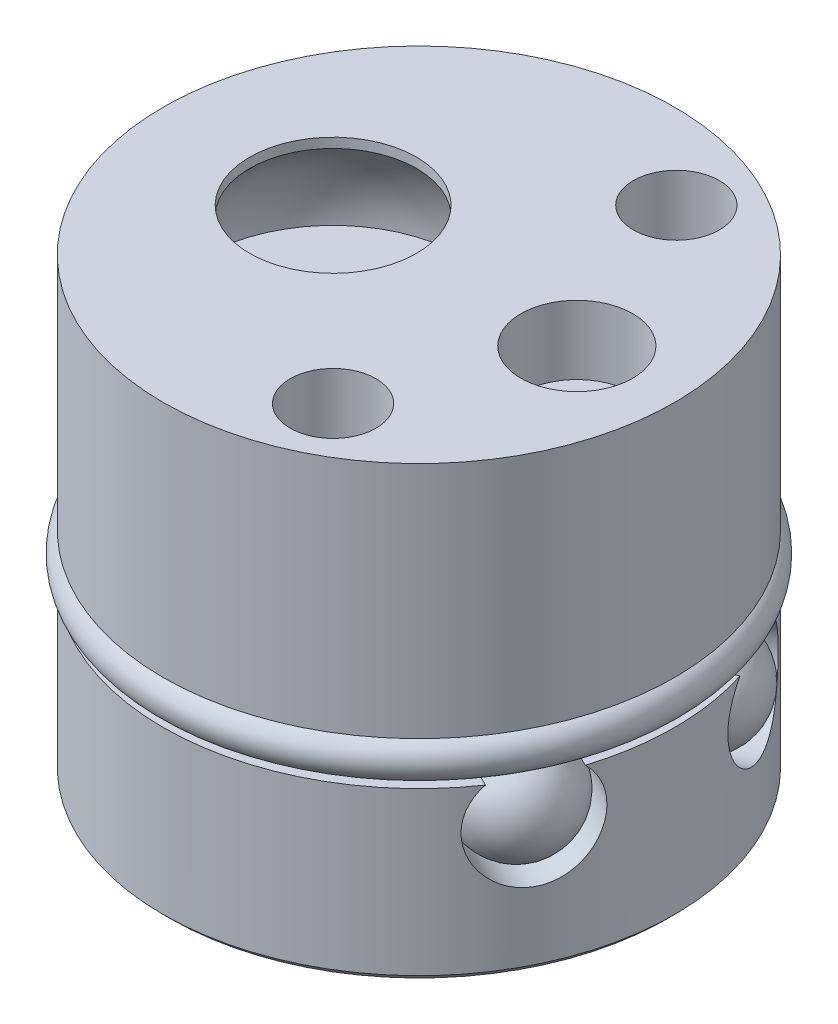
ISO-10303-21;
HEADER;
FILE_DESCRIPTION(('STEP AP214'),'2;1');
FILE_NAME('part.step','',(''),(''),'','','');
FILE_SCHEMA(('AUTOMOTIVE_DESIGN { 1 0 10303 214 1 1 1 1 }'));
ENDSEC;
DATA;
#1=APPLICATION_CONTEXT('core data for automotive mechanical design processes');
#2=APPLICATION_PROTOCOL_DEFINITION('international standard','automotive_design',2000,#1);
#3=PRODUCT_CONTEXT('',#1,'mechanical');
#4=PRODUCT('Part','Part','',(#3));
#5=PRODUCT_RELATED_PRODUCT_CATEGORY('part','',(#4));
#6=PRODUCT_DEFINITION_FORMATION('','',#4);
#7=PRODUCT_DEFINITION_CONTEXT('part definition',#1,'design');
#8=PRODUCT_DEFINITION('design','',#6,#7);
#9=PRODUCT_DEFINITION_SHAPE('','',#8);
#10=(LENGTH_UNIT() NAMED_UNIT(*) SI_UNIT(.MILLI.,.METRE.));
#11=(NAMED_UNIT(*) PLANE_ANGLE_UNIT() SI_UNIT($,.RADIAN.));
#12=(NAMED_UNIT(*) SI_UNIT($,.STERADIAN.) SOLID_ANGLE_UNIT());
#13=UNCERTAINTY_MEASURE_WITH_UNIT(LENGTH_MEASURE(1.E-05),#10,'distance_accuracy_value','');
#14=(GEOMETRIC_REPRESENTATION_CONTEXT(3) GLOBAL_UNCERTAINTY_ASSIGNED_CONTEXT((#13)) GLOBAL_UNIT_ASSIGNED_CONTEXT((#10,
#11,#12)) REPRESENTATION_CONTEXT('',''));
#15=CARTESIAN_POINT('',(0.,0.,0.));
#16=DIRECTION('',(0.,0.,1.));
#17=DIRECTION('',(1.,0.,0.));
#18=AXIS2_PLACEMENT_3D('',#15,#16,#17);
#19=CARTESIAN_POINT('',(0.,7.0993,0.));
#20=DIRECTION('',(0.,1.,0.));
#21=DIRECTION('',(0.,0.,-1.));
#22=AXIS2_PLACEMENT_3D('',#19,#20,#21);
#23=TOROIDAL_SURFACE('',#22,9.0043,0.7493);
#24=CARTESIAN_POINT('',(7.71148854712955,6.63513254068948,-3.37096425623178));
#25=CARTESIAN_POINT('',(7.69420212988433,6.64228336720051,-3.39641917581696));
#26=CARTESIAN_POINT('',(7.67752711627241,6.64842163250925,-3.42257528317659));
#27=CARTESIAN_POINT('',(7.64514777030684,6.6587585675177,-3.47586616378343));
#28=CARTESIAN_POINT('',(7.62944411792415,6.66295589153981,-3.50300160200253));
#29=CARTESIAN_POINT('',(7.59881086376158,6.66947535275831,-3.55809069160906));
#30=CARTESIAN_POINT('',(7.5838851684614,6.67178874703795,-3.58604754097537));
#31=CARTESIAN_POINT('',(7.55483999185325,6.6745366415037,-3.64246859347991));
#32=CARTESIAN_POINT('',(7.54072059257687,6.67497095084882,-3.67093284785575));
#33=CARTESIAN_POINT('',(7.51091574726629,6.67387750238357,-3.73327656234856));
#34=CARTESIAN_POINT('',(7.49539175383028,6.67199114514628,-3.76722777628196));
#35=CARTESIAN_POINT('',(7.46574472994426,6.66559689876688,-3.83547647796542));
#36=CARTESIAN_POINT('',(7.45162096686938,6.66109038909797,-3.86977377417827));
#37=CARTESIAN_POINT('',(7.42522221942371,6.64938057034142,-3.93860615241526));
#38=CARTESIAN_POINT('',(7.41294622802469,6.64217873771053,-3.97314109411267));
#39=CARTESIAN_POINT('',(7.39103571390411,6.62494656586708,-4.0423180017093));
#40=CARTESIAN_POINT('',(7.3813967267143,6.61492106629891,-4.07695968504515));
#41=CARTESIAN_POINT('',(7.36684900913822,6.59293186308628,-4.14290880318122));
#42=CARTESIAN_POINT('',(7.36158195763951,6.58123742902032,-4.17422481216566));
#43=CARTESIAN_POINT('',(7.35625874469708,6.55525448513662,-4.2361391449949));
#44=CARTESIAN_POINT('',(7.35615567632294,6.54099050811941,-4.2667414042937));
#45=CARTESIAN_POINT('',(7.36187436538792,6.51973591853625,-4.30716521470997));
#46=CARTESIAN_POINT('',(7.36403574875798,6.5137669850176,-4.31802787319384));
#47=CARTESIAN_POINT('',(7.36982863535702,6.50154487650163,-4.33921042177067));
#48=CARTESIAN_POINT('',(7.37346071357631,6.49529159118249,-4.34953009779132));
#49=CARTESIAN_POINT('',(7.38249697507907,6.48254554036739,-4.36942207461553));
#50=CARTESIAN_POINT('',(7.38792144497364,6.47605082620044,-4.3789841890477));
#51=CARTESIAN_POINT('',(7.40069344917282,6.46312370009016,-4.39674673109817));
#52=CARTESIAN_POINT('',(7.40803481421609,6.45669115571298,-4.40495139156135));
#53=CARTESIAN_POINT('',(7.4240296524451,6.44459050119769,-4.41904858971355));
#54=CARTESIAN_POINT('',(7.43256068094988,6.43890011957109,-4.42506003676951));
#55=CARTESIAN_POINT('',(7.45096552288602,6.42805357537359,-4.43522122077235));
#56=CARTESIAN_POINT('',(7.46083933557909,6.42289741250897,-4.43937095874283));
#57=CARTESIAN_POINT('',(7.48007151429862,6.41393180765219,-4.44531337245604));
#58=CARTESIAN_POINT('',(7.48931614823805,6.41003461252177,-4.44735053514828));
#59=CARTESIAN_POINT('',(7.50821342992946,6.40277033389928,-4.45008614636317));
#60=CARTESIAN_POINT('',(7.5178668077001,6.39940425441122,-4.4507820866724));
#61=CARTESIAN_POINT('',(7.5575495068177,6.38672915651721,-4.45117290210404));
#62=CARTESIAN_POINT('',(7.58831911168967,6.37957181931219,-4.4457988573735));
#63=CARTESIAN_POINT('',(7.64237387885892,6.3695384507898,-4.42973844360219));
#64=CARTESIAN_POINT('',(7.66599392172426,6.36611675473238,-4.42021247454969));
#65=CARTESIAN_POINT('',(7.71188540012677,6.36062252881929,-4.39790597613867));
#66=CARTESIAN_POINT('',(7.73415361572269,6.35855311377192,-4.3851180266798));
#67=CARTESIAN_POINT('',(7.77453944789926,6.35550120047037,-4.35885315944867));
#68=CARTESIAN_POINT('',(7.79283259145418,6.35441717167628,-4.3456488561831));
#69=CARTESIAN_POINT('',(7.82827884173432,6.35270856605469,-4.3177523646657));
#70=CARTESIAN_POINT('',(7.84543131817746,6.35208424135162,-4.30305936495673));
#71=CARTESIAN_POINT('',(7.89524474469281,6.3506545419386,-4.25711520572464));
#72=CARTESIAN_POINT('',(7.92622443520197,6.35029455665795,-4.22402432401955));
#73=CARTESIAN_POINT('',(7.99747342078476,6.349873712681,-4.13783507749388));
#74=CARTESIAN_POINT('',(8.03522400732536,6.35003429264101,-4.08266621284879));
#75=CARTESIAN_POINT('',(8.10137246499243,6.35016301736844,-3.96695228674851));
#76=CARTESIAN_POINT('',(8.12975940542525,6.350130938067,-3.90640104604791));
#77=CARTESIAN_POINT('',(8.17248830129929,6.34999957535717,-3.79162461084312));
#78=CARTESIAN_POINT('',(8.18836554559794,6.34991210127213,-3.73797752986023));
#79=CARTESIAN_POINT('',(8.20586811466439,6.3502671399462,-3.65626289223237));
#80=CARTESIAN_POINT('',(8.21064796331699,6.3504659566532,-3.62885366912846));
#81=CARTESIAN_POINT('',(8.21787090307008,6.35119567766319,-3.57374019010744));
#82=CARTESIAN_POINT('',(8.2203156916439,6.35172634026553,-3.54603616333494));
#83=CARTESIAN_POINT('',(8.22245573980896,6.3533095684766,-3.49233957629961));
#84=CARTESIAN_POINT('',(8.22231996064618,6.35432582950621,-3.46635326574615));
#85=CARTESIAN_POINT('',(8.21930511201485,6.35715830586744,-3.41460454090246));
#86=CARTESIAN_POINT('',(8.21643078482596,6.35897313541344,-3.38884181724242));
#87=CARTESIAN_POINT('',(8.20801547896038,6.36350076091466,-3.34177054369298));
#88=CARTESIAN_POINT('',(8.20293358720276,6.36604030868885,-3.32036840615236));
#89=CARTESIAN_POINT('',(8.1898741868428,6.37242982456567,-3.27872266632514));
#90=CARTESIAN_POINT('',(8.18190512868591,6.37627596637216,-3.25847588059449));
#91=CARTESIAN_POINT('',(8.16067288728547,6.38671671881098,-3.21684533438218));
#92=CARTESIAN_POINT('',(8.14674583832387,6.39366416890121,-3.19584064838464));
#93=CARTESIAN_POINT('',(8.12316984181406,6.40594660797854,-3.17064901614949));
#94=CARTESIAN_POINT('',(8.115687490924,6.40989987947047,-3.16375026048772));
#95=CARTESIAN_POINT('',(8.0998769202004,6.41839705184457,-3.15146783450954));
#96=CARTESIAN_POINT('',(8.09155058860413,6.42293964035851,-3.14608087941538));
#97=CARTESIAN_POINT('',(8.07420502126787,6.43255637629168,-3.13706895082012));
#98=CARTESIAN_POINT('',(8.06518258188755,6.43763302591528,-3.13345276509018));
#99=CARTESIAN_POINT('',(8.04677936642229,6.44813286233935,-3.12814930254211));
#100=CARTESIAN_POINT('',(8.03739847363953,6.45355616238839,-3.12646265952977));
#101=CARTESIAN_POINT('',(8.01917234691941,6.46420621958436,-3.12499318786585));
#102=CARTESIAN_POINT('',(8.01033015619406,6.46942416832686,-3.1250982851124));
#103=CARTESIAN_POINT('',(7.99277100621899,6.47985759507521,-3.12676282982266));
#104=CARTESIAN_POINT('',(7.98405432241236,6.48507304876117,-3.12832509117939));
#105=CARTESIAN_POINT('',(7.96148751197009,6.49862496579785,-3.1340560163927));
#106=CARTESIAN_POINT('',(7.94784241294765,6.50686977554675,-3.13924437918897));
#107=CARTESIAN_POINT('',(7.9213952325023,6.52281766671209,-3.15201431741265));
#108=CARTESIAN_POINT('',(7.90859522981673,6.53051941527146,-3.15960154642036));
#109=CARTESIAN_POINT('',(7.87460915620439,6.55077352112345,-3.18276358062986));
#110=CARTESIAN_POINT('',(7.85424709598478,6.56268518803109,-3.20008814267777));
#111=CARTESIAN_POINT('',(7.81548349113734,6.58454958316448,-3.23780745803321));
#112=CARTESIAN_POINT('',(7.7970853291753,6.59449895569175,-3.25820736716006));
#113=CARTESIAN_POINT('',(7.76749039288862,6.60962122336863,-3.29406462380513));
#114=CARTESIAN_POINT('',(7.75588965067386,6.61529798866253,-3.30898551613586));
#115=CARTESIAN_POINT('',(7.73327690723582,6.62582424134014,-3.33950232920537));
#116=CARTESIAN_POINT('',(7.72226394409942,6.63067511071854,-3.35509706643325));
#117=CARTESIAN_POINT('',(7.71148854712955,6.63513254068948,-3.37096425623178));
#118=B_SPLINE_CURVE_WITH_KNOTS('',3,(#24,#25,#26,#27,#28,#29,#30,#31,#32,#33,#34,#35,#36,#37,
#38,#39,#40,#41,#42,#43,#44,#45,#46,#47,#48,#49,#50,#51,#52,#53,#54,#55,#56,#57,#58,#59,#60,#61,
#62,#63,#64,#65,#66,#67,#68,#69,#70,#71,#72,#73,#74,#75,#76,#77,#78,#79,#80,#81,#82,#83,#84,#85,
#86,#87,#88,#89,#90,#91,#92,#93,#94,#95,#96,#97,#98,#99,#100,#101,#102,#103,#104,#105,#106,#107,
#108,#109,#110,#111,#112,#113,#114,#115,#116,#117),.UNSPECIFIED.,.T.,.F.,(4,2,2,2,2,2,2,2,2,2,2,
2,2,2,2,2,2,2,2,2,2,2,2,2,2,2,2,2,2,2,2,2,2,2,2,2,2,2,2,2,2,2,2,2,2,2,4),(0.,0.0947513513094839,
0.189568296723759,0.284822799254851,0.380086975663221,0.492109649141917,0.604073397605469,
0.715975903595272,0.827687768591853,0.928942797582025,1.02927791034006,1.06694479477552,
1.10462641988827,1.1427500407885,1.18075244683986,1.21618262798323,1.25161278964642,
1.28220479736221,1.31285395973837,1.40706270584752,1.48392426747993,1.56096225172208,
1.62863756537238,1.69634996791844,1.83190874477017,2.03146228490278,2.23124795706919,
2.39846151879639,2.48185242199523,2.56518265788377,2.64307685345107,2.72083640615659,
2.7870552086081,2.85308174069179,2.93018487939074,2.96281034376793,2.99536436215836,
3.02807833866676,3.06080305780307,3.09148877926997,3.12223388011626,3.17223978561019,
3.22236443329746,3.30967803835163,3.39713968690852,3.45630243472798,3.51536518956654),.UNSPECIFIED.);
#119=CARTESIAN_POINT('',(7.71148854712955,6.63513254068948,-3.37096425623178));
#120=VERTEX_POINT('',#119);
#121=EDGE_CURVE('E21',#120,#120,#118,.T.);
#122=ORIENTED_EDGE('',*,*,#121,.F.);
#123=EDGE_LOOP('',(#122));
#124=FACE_BOUND('',#123,.T.);
#125=CARTESIAN_POINT('',(7.40402249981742,6.63513254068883,4.00136307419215));
#126=CARTESIAN_POINT('',(7.41343866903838,6.64228336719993,3.97206957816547));
#127=CARTESIAN_POINT('',(7.42378379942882,6.64842163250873,3.94282618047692));
#128=CARTESIAN_POINT('',(7.44584287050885,6.6587585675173,3.88450176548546));
#129=CARTESIAN_POINT('',(7.45755775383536,6.66295589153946,3.85542087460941));
#130=CARTESIAN_POINT('',(7.48210883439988,6.66947535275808,3.79736531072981));
#131=CARTESIAN_POINT('',(7.49494995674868,6.67178874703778,3.76839174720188));
#132=CARTESIAN_POINT('',(7.52152835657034,6.67453664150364,3.71076756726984));
#133=CARTESIAN_POINT('',(7.53526572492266,6.6749709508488,3.6821169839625));
#134=CARTESIAN_POINT('',(7.56604354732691,6.67387750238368,3.62024782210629));
#135=CARTESIAN_POINT('',(7.58323994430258,6.67199114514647,3.58711229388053));
#136=CARTESIAN_POINT('',(7.618768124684,6.66559689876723,3.52173202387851));
#137=CARTESIAN_POINT('',(7.63709930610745,6.6610903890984,3.48948682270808));
#138=CARTESIAN_POINT('',(7.67508726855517,6.64938057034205,3.42630688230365));
#139=CARTESIAN_POINT('',(7.69474331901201,6.64217873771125,3.39537143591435));
#140=CARTESIAN_POINT('',(7.73576600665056,6.62494656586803,3.33551615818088));
#141=CARTESIAN_POINT('',(7.7571296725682,6.61492106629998,3.3065929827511));
#142=CARTESIAN_POINT('',(7.80014181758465,6.59293186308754,3.25452689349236));
#143=CARTESIAN_POINT('',(7.82157644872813,6.58123742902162,3.23109633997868));
#144=CARTESIAN_POINT('',(7.86708831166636,6.55525448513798,3.18878332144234));
#145=CARTESIAN_POINT('',(7.89113976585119,6.54099050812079,3.16986147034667));
#146=CARTESIAN_POINT('',(7.92651493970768,6.51973591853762,3.14948047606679));
#147=CARTESIAN_POINT('',(7.93640551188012,6.51376698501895,3.14449594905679));
#148=CARTESIAN_POINT('',(7.95666404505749,6.50154487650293,3.136019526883));
#149=CARTESIAN_POINT('',(7.96703219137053,6.49529159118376,3.13252821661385));
#150=CARTESIAN_POINT('',(7.98827056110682,6.48254554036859,3.12740216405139));
#151=CARTESIAN_POINT('',(7.9991452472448,6.4760508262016,3.12578967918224));
#152=CARTESIAN_POINT('',(8.02100555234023,6.46312370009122,3.1249184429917));
#153=CARTESIAN_POINT('',(8.03199070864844,6.45669115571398,3.12565222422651));
#154=CARTESIAN_POINT('',(8.05294685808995,6.44459050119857,3.1295772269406));
#155=CARTESIAN_POINT('',(8.0629361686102,6.43890011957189,3.1325987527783));
#156=CARTESIAN_POINT('',(8.08227444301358,6.42805357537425,3.14084611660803));
#157=CARTESIAN_POINT('',(8.09162340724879,6.42289741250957,3.1460719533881));
#158=CARTESIAN_POINT('',(8.10814660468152,6.4139318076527,3.15756860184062));
#159=CARTESIAN_POINT('',(8.11544347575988,6.41003461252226,3.16359927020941));
#160=CARTESIAN_POINT('',(8.12923349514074,6.40277033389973,3.17680632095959));
#161=CARTESIAN_POINT('',(8.13572511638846,6.39940425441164,3.18398482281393));
#162=CARTESIAN_POINT('',(8.16046419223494,6.38672915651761,3.2150146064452));
#163=CARTESIAN_POINT('',(8.17517304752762,6.37957181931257,3.24256997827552));
#164=CARTESIAN_POINT('',(8.19579670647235,6.36953845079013,3.29505349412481));
#165=CARTESIAN_POINT('',(8.20283209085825,6.3661167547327,3.31953111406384));
#166=CARTESIAN_POINT('',(8.21350794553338,6.36062252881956,3.36942734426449));
#167=CARTESIAN_POINT('',(8.21714058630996,6.35855311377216,3.39484798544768));
#168=CARTESIAN_POINT('',(8.22130758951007,6.35550120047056,3.44284272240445));
#169=CARTESIAN_POINT('',(8.22216484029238,6.35441717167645,3.46538729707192));
#170=CARTESIAN_POINT('',(8.22200499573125,6.35270856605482,3.51049411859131));
#171=CARTESIAN_POINT('',(8.22098687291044,6.35208424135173,3.53305636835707));
#172=CARTESIAN_POINT('',(8.21545058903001,6.35065454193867,3.60059593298));
#173=CARTESIAN_POINT('',(8.20844762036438,6.35029455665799,3.64538104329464));
#174=CARTESIAN_POINT('',(8.18439482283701,6.349873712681,3.75458940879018));
#175=CARTESIAN_POINT('',(8.16416274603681,6.350034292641,3.8183026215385));
#176=CARTESIAN_POINT('',(8.11370398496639,6.35016301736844,3.94166892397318));
#177=CARTESIAN_POINT('',(8.08346570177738,6.35013093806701,4.00131720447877));
#178=CARTESIAN_POINT('',(8.01932717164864,6.34999957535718,4.10565146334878));
#179=CARTESIAN_POINT('',(7.98682770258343,6.34991210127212,4.15119134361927));
#180=CARTESIAN_POINT('',(7.9332113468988,6.35026713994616,4.215292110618));
#181=CARTESIAN_POINT('',(7.9145553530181,6.35046595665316,4.23593348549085));
#182=CARTESIAN_POINT('',(7.87557222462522,6.35119567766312,4.27555648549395));
#183=CARTESIAN_POINT('',(7.85524631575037,6.35172634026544,4.29453930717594));
#184=CARTESIAN_POINT('',(7.81425037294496,6.35330956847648,4.32928460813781));
#185=CARTESIAN_POINT('',(7.79368928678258,6.35432582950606,4.34517638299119));
#186=CARTESIAN_POINT('',(7.75105460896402,6.35715830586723,4.37466034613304));
#187=CARTESIAN_POINT('',(7.72898369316,6.3589731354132,4.38825646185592));
#188=CARTESIAN_POINT('',(7.68671004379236,6.36350076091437,4.41060508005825));
#189=CARTESIAN_POINT('',(7.66671620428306,6.36604030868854,4.41977696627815));
#190=CARTESIAN_POINT('',(7.62585874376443,6.37242982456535,4.43512569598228));
#191=CARTESIAN_POINT('',(7.60499781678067,6.37627596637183,4.44131115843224));
#192=CARTESIAN_POINT('',(7.55912062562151,6.38671671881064,4.45021024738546));
#193=CARTESIAN_POINT('',(7.53399435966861,6.39366416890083,4.45216735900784));
#194=CARTESIAN_POINT('',(7.49962824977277,6.40594660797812,4.44909873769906));
#195=CARTESIAN_POINT('',(7.48958536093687,6.40989987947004,4.44744986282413));
#196=CARTESIAN_POINT('',(7.47017271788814,6.41839705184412,4.44255277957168));
#197=CARTESIAN_POINT('',(7.46080153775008,6.42293964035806,4.43930808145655));
#198=CARTESIAN_POINT('',(7.44302104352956,6.43255637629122,4.43118788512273));
#199=CARTESIAN_POINT('',(7.43461668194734,6.43763302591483,4.42630445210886));
#200=CARTESIAN_POINT('',(7.41910734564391,6.4481328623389,4.41506765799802));
#201=CARTESIAN_POINT('',(7.41200279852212,6.45355616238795,4.40871381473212));
#202=CARTESIAN_POINT('',(7.39962371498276,6.46420621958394,4.39525612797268));
#203=CARTESIAN_POINT('',(7.39426273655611,6.46942416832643,4.38822368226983));
#204=CARTESIAN_POINT('',(7.38476392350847,6.47985759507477,4.37336208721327));
#205=CARTESIAN_POINT('',(7.38062847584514,6.48507304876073,4.36553142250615));
#206=CARTESIAN_POINT('',(7.37125099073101,6.49862496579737,4.34422022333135));
#207=CARTESIAN_POINT('',(7.36693871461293,6.50686977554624,4.33027346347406));
#208=CARTESIAN_POINT('',(7.36071905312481,6.52281766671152,4.30157084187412));
#209=CARTESIAN_POINT('',(7.35881740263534,6.53051941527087,4.28681313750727));
#210=CARTESIAN_POINT('',(7.356145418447,6.55077352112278,4.2457717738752));
#211=CARTESIAN_POINT('',(7.3572612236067,6.56268518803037,4.21906018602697));
#212=CARTESIAN_POINT('',(7.36311919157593,6.58454958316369,4.16529171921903));
#213=CARTESIAN_POINT('',(7.36786749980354,6.59449895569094,4.13823433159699));
#214=CARTESIAN_POINT('',(7.37790294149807,6.60962122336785,4.09283727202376));
#215=CARTESIAN_POINT('',(7.38251863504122,6.61529798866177,4.07450954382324));
#216=CARTESIAN_POINT('',(7.39264441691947,6.62582424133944,4.03790243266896));
#217=CARTESIAN_POINT('',(7.3981529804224,6.63067511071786,4.0196230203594));
#218=CARTESIAN_POINT('',(7.40402249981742,6.63513254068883,4.00136307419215));
#219=B_SPLINE_CURVE_WITH_KNOTS('',3,(#125,#126,#127,#128,#129,#130,#131,#132,#133,#134,#135,
#136,#137,#138,#139,#140,#141,#142,#143,#144,#145,#146,#147,#148,#149,#150,#151,#152,#153,#154,
#155,#156,#157,#158,#159,#160,#161,#162,#163,#164,#165,#166,#167,#168,#169,#170,#171,#172,#173,
#174,#175,#176,#177,#178,#179,#180,#181,#182,#183,#184,#185,#186,#187,#188,#189,#190,#191,#192,
#193,#194,#195,#196,#197,#198,#199,#200,#201,#202,#203,#204,#205,#206,#207,#208,#209,#210,#211,
#212,#213,#214,#215,#216,#217,#218),.UNSPECIFIED.,.T.,.F.,(4,2,2,2,2,2,2,2,2,2,2,2,2,2,2,2,2,2,
2,2,2,2,2,2,2,2,2,2,2,2,2,2,2,2,2,2,2,2,2,2,2,2,2,2,2,2,4),(0.,0.0947513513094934,
0.189568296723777,0.284822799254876,0.380086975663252,0.49210964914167,0.604073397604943,
0.715975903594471,0.82768776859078,0.928942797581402,1.02927791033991,1.06694479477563,
1.10462641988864,1.14275004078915,1.18075244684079,1.21618262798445,1.25161278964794,
1.28220479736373,1.31285395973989,1.40706270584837,1.48392426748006,1.56096225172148,
1.62863756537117,1.69634996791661,1.8319087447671,2.03146228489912,2.23124795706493,
2.3984615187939,2.48185242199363,2.56518265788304,2.64307685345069,2.72083640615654,
2.78705520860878,2.85308174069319,2.93018487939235,2.96281034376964,2.99536436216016,
3.02807833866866,3.06080305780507,3.09148877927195,3.12223388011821,3.17223978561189,
3.2223644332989,3.30967803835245,3.39713968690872,3.45630243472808,3.51536518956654),.UNSPECIFIED.);
#220=CARTESIAN_POINT('',(7.40402249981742,6.63513254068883,4.00136307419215));
#221=VERTEX_POINT('',#220);
#222=EDGE_CURVE('E61',#221,#221,#219,.T.);
#223=ORIENTED_EDGE('',*,*,#222,.F.);
#224=EDGE_LOOP('',(#223));
#225=FACE_BOUND('',#224,.T.);
#226=ADVANCED_FACE('F16',(#124,#225),#23,.T.);
#227=CARTESIAN_POINT('',(7.0200308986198,4.7752,-3.42389784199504));
#228=DIRECTION('',(-0.438371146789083,0.,-0.898794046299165));
#229=DIRECTION('',(-0.898794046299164,0.,0.438371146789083));
#230=AXIS2_PLACEMENT_3D('',#227,#228,#229);
#231=SPHERICAL_SURFACE('',#230,1.98501);
#232=ORIENTED_EDGE('',*,*,#121,.T.);
#233=EDGE_LOOP('',(#232));
#234=FACE_BOUND('',#233,.T.);
#235=CARTESIAN_POINT('',(7.0200308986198,6.76021,-3.42389784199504));
#236=CARTESIAN_POINT('',(7.04451294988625,6.76020962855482,-3.37370219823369));
#237=CARTESIAN_POINT('',(7.06898327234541,6.75785162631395,-3.32353060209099));
#238=CARTESIAN_POINT('',(7.11774881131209,6.74844459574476,-3.22354643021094));
#239=CARTESIAN_POINT('',(7.14204403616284,6.74139579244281,-3.1737338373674));
#240=CARTESIAN_POINT('',(7.21436353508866,6.71328013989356,-3.0254568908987));
#241=CARTESIAN_POINT('',(7.26190338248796,6.68524386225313,-2.92798575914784));
#242=CARTESIAN_POINT('',(7.35424360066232,6.6113635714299,-2.73866025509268));
#243=CARTESIAN_POINT('',(7.39904264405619,6.56551100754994,-2.64680860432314));
#244=CARTESIAN_POINT('',(7.4846290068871,6.45730451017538,-2.47133055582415));
#245=CARTESIAN_POINT('',(7.5254170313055,6.39495348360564,-2.38770271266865));
#246=CARTESIAN_POINT('',(7.60182366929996,6.25551908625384,-2.23104588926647));
#247=CARTESIAN_POINT('',(7.63744233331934,6.17843585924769,-2.1580168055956));
#248=CARTESIAN_POINT('',(7.70250869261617,6.0117040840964,-2.02461099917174));
#249=CARTESIAN_POINT('',(7.73195517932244,5.92205308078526,-1.96423675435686));
#250=CARTESIAN_POINT('',(7.78383602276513,5.73273741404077,-1.85786526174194));
#251=CARTESIAN_POINT('',(7.80626900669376,5.63307079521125,-1.81187082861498));
#252=CARTESIAN_POINT('',(7.84346988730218,5.42658043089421,-1.73559772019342));
#253=CARTESIAN_POINT('',(7.85824227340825,5.31976091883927,-1.70530984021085));
#254=CARTESIAN_POINT('',(7.87603139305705,5.13943977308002,-1.6688367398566));
#255=CARTESIAN_POINT('',(7.88134216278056,5.06707248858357,-1.65794804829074));
#256=CARTESIAN_POINT('',(7.88842700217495,4.92154691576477,-1.64342197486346));
#257=CARTESIAN_POINT('',(7.89020608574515,4.84838989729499,-1.63977431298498));
#258=CARTESIAN_POINT('',(7.8902020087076,4.7752,-1.63978267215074));
#259=B_SPLINE_CURVE_WITH_KNOTS('',3,(#235,#236,#237,#238,#239,#240,#241,#242,#243,#244,#245,
#246,#247,#248,#249,#250,#251,#252,#253,#254,#255,#256,#257,#258),.UNSPECIFIED.,.F.,.F.,(4,2,2,
2,2,2,2,2,2,2,2,4),(0.,0.167440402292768,0.334872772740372,0.669185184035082,1.00365824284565,
1.33807240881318,1.67248331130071,2.00695963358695,2.34150138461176,2.67584685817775,
2.89555223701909,3.11494547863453),.UNSPECIFIED.);
#260=CARTESIAN_POINT('',(7.0200308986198,6.76021,-3.42389784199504));
#261=VERTEX_POINT('',#260);
#262=CARTESIAN_POINT('',(7.8902020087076,4.7752,-1.63978267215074));
#263=VERTEX_POINT('',#262);
#264=EDGE_CURVE('E72',#261,#263,#259,.T.);
#265=ORIENTED_EDGE('',*,*,#264,.T.);
#266=CARTESIAN_POINT('',(7.0200308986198,4.7752,-3.42389784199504));
#267=DIRECTION('',(-0.898794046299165,0.,0.438371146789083));
#268=DIRECTION('',(-0.438371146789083,0.,-0.898794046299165));
#269=AXIS2_PLACEMENT_3D('',#266,#267,#268);
#270=CIRCLE('',#269,1.98501);
#271=CARTESIAN_POINT('',(7.0200308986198,2.79019,-3.42389784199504));
#272=VERTEX_POINT('',#271);
#273=EDGE_CURVE('E241',#263,#272,#270,.F.);
#274=ORIENTED_EDGE('',*,*,#273,.T.);
#275=CARTESIAN_POINT('',(7.0200308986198,2.79019,-3.42389784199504));
#276=CARTESIAN_POINT('',(6.99554884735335,2.79019037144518,-3.47409348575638));
#277=CARTESIAN_POINT('',(6.97107852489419,2.79254837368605,-3.52426508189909));
#278=CARTESIAN_POINT('',(6.92231298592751,2.80195540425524,-3.62424925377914));
#279=CARTESIAN_POINT('',(6.89801776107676,2.80900420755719,-3.67406184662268));
#280=CARTESIAN_POINT('',(6.82569826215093,2.83711986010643,-3.82233879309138));
#281=CARTESIAN_POINT('',(6.77815841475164,2.86515613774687,-3.91980992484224));
#282=CARTESIAN_POINT('',(6.68581819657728,2.9390364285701,-4.1091354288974));
#283=CARTESIAN_POINT('',(6.64101915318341,2.98488899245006,-4.20098707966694));
#284=CARTESIAN_POINT('',(6.55543279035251,3.09309548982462,-4.37646512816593));
#285=CARTESIAN_POINT('',(6.5146447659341,3.15544651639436,-4.46009297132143));
#286=CARTESIAN_POINT('',(6.43823812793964,3.29488091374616,-4.61674979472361));
#287=CARTESIAN_POINT('',(6.40261946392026,3.37196414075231,-4.68977887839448));
#288=CARTESIAN_POINT('',(6.33755310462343,3.5386959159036,-4.82318468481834));
#289=CARTESIAN_POINT('',(6.30810661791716,3.62834691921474,-4.88355892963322));
#290=CARTESIAN_POINT('',(6.25622577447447,3.81766258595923,-4.98993042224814));
#291=CARTESIAN_POINT('',(6.23379279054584,3.91732920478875,-5.0359248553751));
#292=CARTESIAN_POINT('',(6.19659190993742,4.12381956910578,-5.11219796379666));
#293=CARTESIAN_POINT('',(6.18181952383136,4.23063908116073,-5.14248584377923));
#294=CARTESIAN_POINT('',(6.16403040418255,4.41096022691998,-5.17895894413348));
#295=CARTESIAN_POINT('',(6.15871963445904,4.48332751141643,-5.18984763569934));
#296=CARTESIAN_POINT('',(6.15163479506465,4.62885308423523,-5.20437370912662));
#297=CARTESIAN_POINT('',(6.14985571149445,4.70201010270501,-5.2080213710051));
#298=CARTESIAN_POINT('',(6.149859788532,4.7752,-5.20801301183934));
#299=B_SPLINE_CURVE_WITH_KNOTS('',3,(#275,#276,#277,#278,#279,#280,#281,#282,#283,#284,#285,
#286,#287,#288,#289,#290,#291,#292,#293,#294,#295,#296,#297,#298),.UNSPECIFIED.,.F.,.F.,(4,2,2,
2,2,2,2,2,2,2,2,4),(0.,0.167440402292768,0.334872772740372,0.669185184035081,1.00365824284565,
1.33807240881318,1.67248331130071,2.00695963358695,2.34150138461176,2.67584685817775,
2.89555223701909,3.11494547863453),.UNSPECIFIED.);
#300=CARTESIAN_POINT('',(6.149859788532,4.7752,-5.20801301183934));
#301=VERTEX_POINT('',#300);
#302=EDGE_CURVE('E236',#272,#301,#299,.T.);
#303=ORIENTED_EDGE('',*,*,#302,.T.);
#304=CARTESIAN_POINT('',(7.0200308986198,4.7752,-3.42389784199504));
#305=DIRECTION('',(0.898794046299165,0.,-0.438371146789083));
#306=DIRECTION('',(-0.438371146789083,0.,-0.898794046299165));
#307=AXIS2_PLACEMENT_3D('',#304,#305,#306);
#308=CIRCLE('',#307,1.98501);
#309=EDGE_CURVE('E234',#301,#261,#308,.T.);
#310=ORIENTED_EDGE('',*,*,#309,.T.);
#311=EDGE_LOOP('',(#265,#274,#303,#310));
#312=FACE_BOUND('',#311,.T.);
#313=ADVANCED_FACE('F177',(#234,#312),#231,.T.);
#314=CARTESIAN_POINT('',(7.0200308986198,4.7752,-3.42389784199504));
#315=DIRECTION('',(-0.898794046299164,0.,0.438371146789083));
#316=DIRECTION('',(0.438371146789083,0.,0.898794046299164));
#317=AXIS2_PLACEMENT_3D('',#314,#315,#316);
#318=PLANE('',#317);
#319=ORIENTED_EDGE('',*,*,#264,.F.);
#320=ORIENTED_EDGE('',*,*,#309,.F.);
#321=ORIENTED_EDGE('',*,*,#302,.F.);
#322=ORIENTED_EDGE('',*,*,#273,.F.);
#323=EDGE_LOOP('',(#319,#320,#321,#322));
#324=FACE_BOUND('',#323,.T.);
#325=CARTESIAN_POINT('',(7.0200308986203,4.7752,-3.4238978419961));
#326=DIRECTION('',(-0.898794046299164,0.,0.438371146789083));
#327=DIRECTION('',(0.438371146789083,0.,0.898794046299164));
#328=AXIS2_PLACEMENT_3D('',#325,#326,#327);
#329=CIRCLE('',#328,2.0193);
#330=CARTESIAN_POINT('',(7.9052337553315,4.7752,-1.60896302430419));
#331=VERTEX_POINT('',#330);
#332=EDGE_CURVE('E231',#331,#331,#329,.F.);
#333=ORIENTED_EDGE('',*,*,#332,.T.);
#334=EDGE_LOOP('',(#333));
#335=FACE_BOUND('',#334,.T.);
#336=ADVANCED_FACE('F243',(#324,#335),#318,.F.);
#337=CARTESIAN_POINT('',(7.0200308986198,4.7752,3.42389784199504));
#338=DIRECTION('',(0.438371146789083,0.,-0.898794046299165));
#339=DIRECTION('',(-0.898794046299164,0.,-0.438371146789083));
#340=AXIS2_PLACEMENT_3D('',#337,#338,#339);
#341=SPHERICAL_SURFACE('',#340,1.98501);
#342=ORIENTED_EDGE('',*,*,#222,.T.);
#343=EDGE_LOOP('',(#342));
#344=FACE_BOUND('',#343,.T.);
#345=CARTESIAN_POINT('',(7.0200308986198,6.76021,3.42389784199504));
#346=CARTESIAN_POINT('',(6.99554884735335,6.76020962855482,3.47409348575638));
#347=CARTESIAN_POINT('',(6.97107852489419,6.75785162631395,3.52426508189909));
#348=CARTESIAN_POINT('',(6.92231298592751,6.74844459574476,3.62424925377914));
#349=CARTESIAN_POINT('',(6.89801776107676,6.7413957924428,3.67406184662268));
#350=CARTESIAN_POINT('',(6.82569826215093,6.71328013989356,3.82233879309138));
#351=CARTESIAN_POINT('',(6.77815841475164,6.68524386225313,3.91980992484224));
#352=CARTESIAN_POINT('',(6.68581819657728,6.6113635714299,4.1091354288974));
#353=CARTESIAN_POINT('',(6.64101915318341,6.56551100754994,4.20098707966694));
#354=CARTESIAN_POINT('',(6.55543279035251,6.45730451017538,4.37646512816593));
#355=CARTESIAN_POINT('',(6.5146447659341,6.39495348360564,4.46009297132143));
#356=CARTESIAN_POINT('',(6.43823812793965,6.25551908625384,4.61674979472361));
#357=CARTESIAN_POINT('',(6.40261946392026,6.17843585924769,4.68977887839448));
#358=CARTESIAN_POINT('',(6.33755310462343,6.0117040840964,4.82318468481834));
#359=CARTESIAN_POINT('',(6.30810661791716,5.92205308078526,4.88355892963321));
#360=CARTESIAN_POINT('',(6.25622577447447,5.73273741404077,4.98993042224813));
#361=CARTESIAN_POINT('',(6.23379279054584,5.63307079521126,5.0359248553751));
#362=CARTESIAN_POINT('',(6.19659190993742,5.42658043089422,5.11219796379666));
#363=CARTESIAN_POINT('',(6.18181952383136,5.31976091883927,5.14248584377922));
#364=CARTESIAN_POINT('',(6.16403040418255,5.13943977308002,5.17895894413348));
#365=CARTESIAN_POINT('',(6.15871963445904,5.06707248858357,5.18984763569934));
#366=CARTESIAN_POINT('',(6.15163479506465,4.92154691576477,5.20437370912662));
#367=CARTESIAN_POINT('',(6.14985571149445,4.84838989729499,5.2080213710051));
#368=CARTESIAN_POINT('',(6.149859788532,4.7752,5.20801301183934));
#369=B_SPLINE_CURVE_WITH_KNOTS('',3,(#345,#346,#347,#348,#349,#350,#351,#352,#353,#354,#355,
#356,#357,#358,#359,#360,#361,#362,#363,#364,#365,#366,#367,#368),.UNSPECIFIED.,.F.,.F.,(4,2,2,
2,2,2,2,2,2,2,2,4),(0.,0.167440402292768,0.334872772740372,0.669185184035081,1.00365824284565,
1.33807240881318,1.67248331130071,2.00695963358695,2.34150138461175,2.67584685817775,
2.89555223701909,3.11494547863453),.UNSPECIFIED.);
#370=CARTESIAN_POINT('',(7.0200308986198,6.76021,3.42389784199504));
#371=VERTEX_POINT('',#370);
#372=CARTESIAN_POINT('',(6.149859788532,4.7752,5.20801301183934));
#373=VERTEX_POINT('',#372);
#374=EDGE_CURVE('E226',#371,#373,#369,.T.);
#375=ORIENTED_EDGE('',*,*,#374,.T.);
#376=CARTESIAN_POINT('',(7.0200308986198,4.7752,3.42389784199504));
#377=DIRECTION('',(-0.898794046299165,0.,-0.438371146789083));
#378=DIRECTION('',(0.438371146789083,0.,-0.898794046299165));
#379=AXIS2_PLACEMENT_3D('',#376,#377,#378);
#380=CIRCLE('',#379,1.98501);
#381=CARTESIAN_POINT('',(7.0200308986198,2.79019,3.42389784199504));
#382=VERTEX_POINT('',#381);
#383=EDGE_CURVE('E215',#373,#382,#380,.F.);
#384=ORIENTED_EDGE('',*,*,#383,.T.);
#385=CARTESIAN_POINT('',(7.0200308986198,2.79019,3.42389784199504));
#386=CARTESIAN_POINT('',(7.04451294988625,2.79019037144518,3.37370219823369));
#387=CARTESIAN_POINT('',(7.06898327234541,2.79254837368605,3.32353060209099));
#388=CARTESIAN_POINT('',(7.11774881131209,2.80195540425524,3.22354643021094));
#389=CARTESIAN_POINT('',(7.14204403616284,2.80900420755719,3.1737338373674));
#390=CARTESIAN_POINT('',(7.21436353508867,2.83711986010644,3.0254568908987));
#391=CARTESIAN_POINT('',(7.26190338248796,2.86515613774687,2.92798575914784));
#392=CARTESIAN_POINT('',(7.35424360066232,2.9390364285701,2.73866025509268));
#393=CARTESIAN_POINT('',(7.39904264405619,2.98488899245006,2.64680860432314));
#394=CARTESIAN_POINT('',(7.4846290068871,3.09309548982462,2.47133055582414));
#395=CARTESIAN_POINT('',(7.5254170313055,3.15544651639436,2.38770271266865));
#396=CARTESIAN_POINT('',(7.60182366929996,3.29488091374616,2.23104588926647));
#397=CARTESIAN_POINT('',(7.63744233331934,3.37196414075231,2.1580168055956));
#398=CARTESIAN_POINT('',(7.70250869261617,3.5386959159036,2.02461099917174));
#399=CARTESIAN_POINT('',(7.73195517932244,3.62834691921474,1.96423675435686));
#400=CARTESIAN_POINT('',(7.78383602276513,3.81766258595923,1.85786526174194));
#401=CARTESIAN_POINT('',(7.80626900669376,3.91732920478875,1.81187082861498));
#402=CARTESIAN_POINT('',(7.84346988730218,4.12381956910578,1.73559772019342));
#403=CARTESIAN_POINT('',(7.85824227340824,4.23063908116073,1.70530984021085));
#404=CARTESIAN_POINT('',(7.87603139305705,4.41096022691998,1.6688367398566));
#405=CARTESIAN_POINT('',(7.88134216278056,4.48332751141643,1.65794804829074));
#406=CARTESIAN_POINT('',(7.88842700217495,4.62885308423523,1.64342197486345));
#407=CARTESIAN_POINT('',(7.89020608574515,4.70201010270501,1.63977431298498));
#408=CARTESIAN_POINT('',(7.8902020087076,4.7752,1.63978267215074));
#409=B_SPLINE_CURVE_WITH_KNOTS('',3,(#385,#386,#387,#388,#389,#390,#391,#392,#393,#394,#395,
#396,#397,#398,#399,#400,#401,#402,#403,#404,#405,#406,#407,#408),.UNSPECIFIED.,.F.,.F.,(4,2,2,
2,2,2,2,2,2,2,2,4),(0.,0.167440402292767,0.334872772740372,0.669185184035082,1.00365824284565,
1.33807240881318,1.67248331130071,2.00695963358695,2.34150138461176,2.67584685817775,
2.89555223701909,3.11494547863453),.UNSPECIFIED.);
#410=CARTESIAN_POINT('',(7.8902020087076,4.7752,1.63978267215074));
#411=VERTEX_POINT('',#410);
#412=EDGE_CURVE('E208',#382,#411,#409,.T.);
#413=ORIENTED_EDGE('',*,*,#412,.T.);
#414=CARTESIAN_POINT('',(7.0200308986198,4.7752,3.42389784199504));
#415=DIRECTION('',(0.898794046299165,0.,0.438371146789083));
#416=DIRECTION('',(0.438371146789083,0.,-0.898794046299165));
#417=AXIS2_PLACEMENT_3D('',#414,#415,#416);
#418=CIRCLE('',#417,1.98501);
#419=EDGE_CURVE('E205',#411,#371,#418,.T.);
#420=ORIENTED_EDGE('',*,*,#419,.T.);
#421=EDGE_LOOP('',(#375,#384,#413,#420));
#422=FACE_BOUND('',#421,.T.);
#423=ADVANCED_FACE('F217',(#344,#422),#341,.T.);
#424=CARTESIAN_POINT('',(7.0200308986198,4.7752,3.42389784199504));
#425=DIRECTION('',(-0.898794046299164,0.,-0.438371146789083));
#426=DIRECTION('',(-0.438371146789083,0.,0.898794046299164));
#427=AXIS2_PLACEMENT_3D('',#424,#425,#426);
#428=PLANE('',#427);
#429=ORIENTED_EDGE('',*,*,#374,.F.);
#430=ORIENTED_EDGE('',*,*,#419,.F.);
#431=ORIENTED_EDGE('',*,*,#412,.F.);
#432=ORIENTED_EDGE('',*,*,#383,.F.);
#433=EDGE_LOOP('',(#429,#430,#431,#432));
#434=FACE_BOUND('',#433,.T.);
#435=CARTESIAN_POINT('',(7.02003089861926,4.7752,3.42389784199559));
#436=DIRECTION('',(-0.898794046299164,0.,-0.438371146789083));
#437=DIRECTION('',(-0.438371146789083,0.,0.898794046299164));
#438=AXIS2_PLACEMENT_3D('',#435,#436,#437);
#439=CIRCLE('',#438,2.0193);
#440=CARTESIAN_POINT('',(6.13482804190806,4.7752,5.23883265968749));
#441=VERTEX_POINT('',#440);
#442=EDGE_CURVE('E150',#441,#441,#439,.F.);
#443=ORIENTED_EDGE('',*,*,#442,.T.);
#444=EDGE_LOOP('',(#443));
#445=FACE_BOUND('',#444,.T.);
#446=ADVANCED_FACE('F220',(#434,#445),#428,.F.);
#447=CARTESIAN_POINT('',(0.,6.2484,0.));
#448=DIRECTION('',(0.,1.,0.));
#449=DIRECTION('',(0.,0.,1.));
#450=AXIS2_PLACEMENT_3D('',#447,#448,#449);
#451=PLANE('',#450);
#452=CARTESIAN_POINT('',(0.,6.2484,0.));
#453=DIRECTION('',(0.,1.,0.));
#454=DIRECTION('',(0.,0.,1.));
#455=AXIS2_PLACEMENT_3D('',#452,#453,#454);
#456=CIRCLE('',#455,8.255);
#457=CARTESIAN_POINT('',(7.92038360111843,6.24840010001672,2.32648847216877));
#458=VERTEX_POINT('',#457);
#459=CARTESIAN_POINT('',(7.92038363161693,6.24840000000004,-2.32648836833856));
#460=VERTEX_POINT('',#459);
#461=EDGE_CURVE('E163',#458,#460,#456,.T.);
#462=ORIENTED_EDGE('',*,*,#461,.F.);
#463=DIRECTION('',(-0.898794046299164,0.,-0.438371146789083));
#464=VECTOR('',#463,1.);
#465=CARTESIAN_POINT('',(9.10934522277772,6.24840000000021,2.90638368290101));
#466=LINE('',#465,#464);
#467=CARTESIAN_POINT('',(9.01826780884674,6.2484000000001,2.86196226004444));
#468=VERTEX_POINT('',#467);
#469=EDGE_CURVE('E149',#458,#468,#466,.F.);
#470=ORIENTED_EDGE('',*,*,#469,.T.);
#471=CARTESIAN_POINT('',(0.,6.2484,0.));
#472=DIRECTION('',(0.,1.,0.));
#473=DIRECTION('',(0.,0.,1.));
#474=AXIS2_PLACEMENT_3D('',#471,#472,#473);
#475=CIRCLE('',#474,9.4615);
#476=CARTESIAN_POINT('',(9.01826780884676,6.2484,-2.86196226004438));
#477=VERTEX_POINT('',#476);
#478=EDGE_CURVE('E107',#468,#477,#475,.T.);
#479=ORIENTED_EDGE('',*,*,#478,.T.);
#480=DIRECTION('',(-0.898794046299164,0.,0.438371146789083));
#481=VECTOR('',#480,1.);
#482=CARTESIAN_POINT('',(9.10934522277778,6.24840000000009,-2.90638368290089));
#483=LINE('',#482,#481);
#484=EDGE_CURVE('E144',#477,#460,#483,.T.);
#485=ORIENTED_EDGE('',*,*,#484,.T.);
#486=EDGE_LOOP('',(#462,#470,#479,#485));
#487=FACE_BOUND('',#486,.T.);
#488=ADVANCED_FACE('F223',(#487),#451,.T.);
#489=CARTESIAN_POINT('',(8.50393986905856,4.7752,-4.14764860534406));
#490=DIRECTION('',(-0.898794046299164,0.,0.438371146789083));
#491=DIRECTION('',(0.438371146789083,0.,0.898794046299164));
#492=AXIS2_PLACEMENT_3D('',#489,#490,#491);
#493=CYLINDRICAL_SURFACE('',#492,2.0193);
#494=ORIENTED_EDGE('',*,*,#332,.F.);
#495=EDGE_LOOP('',(#494));
#496=FACE_BOUND('',#495,.T.);
#497=CARTESIAN_POINT('',(7.80745710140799,6.24839999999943,-5.34449210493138));
#498=CARTESIAN_POINT('',(7.78386936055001,6.20967108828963,-5.37895043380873));
#499=CARTESIAN_POINT('',(7.7609727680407,6.16922743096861,-5.41190894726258));
#500=CARTESIAN_POINT('',(7.716808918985,6.08514450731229,-5.47469764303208));
#501=CARTESIAN_POINT('',(7.69554174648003,6.04150507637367,-5.5045276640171));
#502=CARTESIAN_POINT('',(7.63451553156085,5.90605484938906,-5.58918644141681));
#503=CARTESIAN_POINT('',(7.59758272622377,5.80979500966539,-5.63911048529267));
#504=CARTESIAN_POINT('',(7.53325160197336,5.60813853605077,-5.72477008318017));
#505=CARTESIAN_POINT('',(7.5058636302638,5.5027321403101,-5.76049024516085));
#506=CARTESIAN_POINT('',(7.46225857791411,5.28598386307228,-5.81686897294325));
#507=CARTESIAN_POINT('',(7.44601071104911,5.17465926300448,-5.83756905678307));
#508=CARTESIAN_POINT('',(7.43146818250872,5.01455854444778,-5.85604798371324));
#509=CARTESIAN_POINT('',(7.42822509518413,4.96685080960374,-5.86015928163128));
#510=CARTESIAN_POINT('',(7.42389243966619,4.87116985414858,-5.86564703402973));
#511=CARTESIAN_POINT('',(7.42280334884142,4.82319657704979,-5.8670228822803));
#512=CARTESIAN_POINT('',(7.4228109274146,4.66327109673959,-5.86701760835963));
#513=CARTESIAN_POINT('',(7.42875141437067,4.55121548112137,-5.85952302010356));
#514=CARTESIAN_POINT('',(7.45219211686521,4.33021374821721,-5.82967920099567));
#515=CARTESIAN_POINT('',(7.46971243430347,4.22127338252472,-5.80730413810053));
#516=CARTESIAN_POINT('',(7.51528172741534,4.00983990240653,-5.74820878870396));
#517=CARTESIAN_POINT('',(7.54331536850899,3.90733765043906,-5.7115093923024));
#518=CARTESIAN_POINT('',(7.60839238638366,3.71140824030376,-5.6245252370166));
#519=CARTESIAN_POINT('',(7.64543353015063,3.61797884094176,-5.57424384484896));
#520=CARTESIAN_POINT('',(7.72727245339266,3.44130422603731,-5.46024030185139));
#521=CARTESIAN_POINT('',(7.77217514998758,3.35822677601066,-5.39633341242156));
#522=CARTESIAN_POINT('',(7.86722330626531,3.20608126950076,-5.25679499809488));
#523=CARTESIAN_POINT('',(7.91736936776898,3.13701482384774,-5.18116212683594));
#524=CARTESIAN_POINT('',(8.0211932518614,3.01420078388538,-5.01894332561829));
#525=CARTESIAN_POINT('',(8.07490129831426,2.96061276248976,-4.93225572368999));
#526=CARTESIAN_POINT('',(8.18310885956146,2.87130882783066,-4.75056590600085));
#527=CARTESIAN_POINT('',(8.23760828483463,2.83559090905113,-4.65556462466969));
#528=CARTESIAN_POINT('',(8.34445229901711,2.78356350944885,-4.46118911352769));
#529=CARTESIAN_POINT('',(8.39681691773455,2.76697200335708,-4.36190143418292));
#530=CARTESIAN_POINT('',(8.49844298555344,2.75278718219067,-4.1604293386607));
#531=CARTESIAN_POINT('',(8.54770476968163,2.75519181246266,-4.05824523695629));
#532=CARTESIAN_POINT('',(8.64095280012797,2.77871978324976,-3.8556654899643));
#533=CARTESIAN_POINT('',(8.68501161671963,2.79953907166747,-3.75526770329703));
#534=CARTESIAN_POINT('',(8.76785439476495,2.85882179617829,-3.55755644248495));
#535=CARTESIAN_POINT('',(8.80663808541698,2.8972861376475,-3.46024312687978));
#536=CARTESIAN_POINT('',(8.87869854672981,2.99104111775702,-3.27093788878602));
#537=CARTESIAN_POINT('',(8.91193450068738,3.04644864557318,-3.1789883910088));
#538=CARTESIAN_POINT('',(8.97245037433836,3.1724259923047,-3.00394834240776));
#539=CARTESIAN_POINT('',(8.99972994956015,3.24299668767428,-2.92085830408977));
#540=CARTESIAN_POINT('',(9.04897350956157,3.39894267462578,-2.76458235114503));
#541=CARTESIAN_POINT('',(9.07082254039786,3.48458156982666,-2.69162307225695));
#542=CARTESIAN_POINT('',(9.10884289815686,3.66741560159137,-2.56001415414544));
#543=CARTESIAN_POINT('',(9.1250117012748,3.76461584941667,-2.501370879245));
#544=CARTESIAN_POINT('',(9.15209958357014,3.96823809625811,-2.40037699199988));
#545=CARTESIAN_POINT('',(9.16300017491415,4.07469104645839,-2.35808385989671));
#546=CARTESIAN_POINT('',(9.17980149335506,4.29337269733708,-2.29181461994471));
#547=CARTESIAN_POINT('',(9.18571274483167,4.40558870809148,-2.2677999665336));
#548=CARTESIAN_POINT('',(9.19057104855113,4.56143224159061,-2.24797792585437));
#549=CARTESIAN_POINT('',(9.19156152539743,4.60407346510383,-2.24392222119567));
#550=CARTESIAN_POINT('',(9.1928815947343,4.68953644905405,-2.23850794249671));
#551=CARTESIAN_POINT('',(9.19321120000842,4.73235820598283,-2.23714931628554));
#552=CARTESIAN_POINT('',(9.19321169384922,4.88710033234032,-2.2371577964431));
#553=CARTESIAN_POINT('',(9.19096433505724,4.99913736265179,-2.24644883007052));
#554=CARTESIAN_POINT('',(9.18187998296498,5.22014544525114,-2.28328853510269));
#555=CARTESIAN_POINT('',(9.17503318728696,5.32910943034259,-2.31087619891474));
#556=CARTESIAN_POINT('',(9.1565157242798,5.54061327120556,-2.38318851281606));
#557=CARTESIAN_POINT('',(9.14485043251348,5.64316013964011,-2.42789406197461));
#558=CARTESIAN_POINT('',(9.11635869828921,5.83910595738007,-2.53276821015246));
#559=CARTESIAN_POINT('',(9.09953911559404,5.93251684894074,-2.59291623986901));
#560=CARTESIAN_POINT('',(9.07089265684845,6.0608217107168,-2.69071219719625));
#561=CARTESIAN_POINT('',(9.06121412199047,6.1002689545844,-2.7231648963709));
#562=CARTESIAN_POINT('',(9.04065408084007,6.17641504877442,-2.79066286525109));
#563=CARTESIAN_POINT('',(9.02977473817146,6.21311864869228,-2.82570343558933));
#564=CARTESIAN_POINT('',(9.01826780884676,6.24840000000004,-2.86196226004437));
#565=B_SPLINE_CURVE_WITH_KNOTS('',3,(#497,#498,#499,#500,#501,#502,#503,#504,#505,#506,#507,
#508,#509,#510,#511,#512,#513,#514,#515,#516,#517,#518,#519,#520,#521,#522,#523,#524,#525,#526,
#527,#528,#529,#530,#531,#532,#533,#534,#535,#536,#537,#538,#539,#540,#541,#542,#543,#544,#545,
#546,#547,#548,#549,#550,#551,#552,#553,#554,#555,#556,#557,#558,#559,#560,#561,#562,#563,#564),
.UNSPECIFIED.,.F.,.F.,(4,2,2,2,2,2,2,2,2,2,2,2,2,2,2,2,2,2,2,2,2,2,2,2,2,2,2,2,2,2,2,2,2,4),(0.,
0.170755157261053,0.34151911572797,0.68340812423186,1.02566661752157,1.36697540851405,
1.51085489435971,1.65476626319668,1.99037023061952,2.32655832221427,2.66225794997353,
2.99787444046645,3.33836911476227,3.67890291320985,4.02283139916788,4.36672127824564,
4.7054727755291,5.04418763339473,5.37741210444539,5.71065367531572,6.04624819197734,
6.3818621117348,6.72406923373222,7.06642821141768,7.40998006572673,7.75280541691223,
7.88127062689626,8.00973335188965,8.34527069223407,8.68152541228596,9.0174060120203,
9.35284152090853,9.50868357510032,9.6642492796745),.UNSPECIFIED.);
#566=CARTESIAN_POINT('',(7.80745710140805,6.2484,-5.34449210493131));
#567=VERTEX_POINT('',#566);
#568=EDGE_CURVE('E147',#567,#477,#565,.T.);
#569=ORIENTED_EDGE('',*,*,#568,.F.);
#570=DIRECTION('',(0.898794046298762,0.,-0.438371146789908));
#571=VECTOR('',#570,1.);
#572=CARTESIAN_POINT('',(6.70957292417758,6.2484,-4.8090182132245));
#573=LINE('',#572,#571);
#574=CARTESIAN_POINT('',(6.70957294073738,6.24840002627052,-4.80901819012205));
#575=VERTEX_POINT('',#574);
#576=EDGE_CURVE('E111',#575,#567,#573,.T.);
#577=ORIENTED_EDGE('',*,*,#576,.F.);
#578=CARTESIAN_POINT('',(7.92038363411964,6.24839999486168,-2.32648836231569));
#579=CARTESIAN_POINT('',(7.90862772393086,6.28695090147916,-2.36651138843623));
#580=CARTESIAN_POINT('',(7.89612580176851,6.32376722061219,-2.40794913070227));
#581=CARTESIAN_POINT('',(7.86957328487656,6.39372203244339,-2.49336011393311));
#582=CARTESIAN_POINT('',(7.85552258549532,6.42686027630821,-2.53733352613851));
#583=CARTESIAN_POINT('',(7.8109804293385,6.52040470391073,-2.6725606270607));
#584=CARTESIAN_POINT('',(7.77808671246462,6.57498141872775,-2.76716374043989));
#585=CARTESIAN_POINT('',(7.70590434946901,6.66685014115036,-2.96224467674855));
#586=CARTESIAN_POINT('',(7.6666086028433,6.70412277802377,-3.06272894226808));
#587=CARTESIAN_POINT('',(7.58211325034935,6.76010640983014,-3.2662979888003));
#588=CARTESIAN_POINT('',(7.53691776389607,6.77883027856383,-3.36938091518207));
#589=CARTESIAN_POINT('',(7.4425096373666,6.79692923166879,-3.57301486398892));
#590=CARTESIAN_POINT('',(7.39338925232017,6.7966639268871,-3.67357687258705));
#591=CARTESIAN_POINT('',(7.29182348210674,6.77768572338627,-3.87126420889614));
#592=CARTESIAN_POINT('',(7.23937703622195,6.75896691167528,-3.96838842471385));
#593=CARTESIAN_POINT('',(7.13349261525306,6.70395628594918,-4.15569420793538));
#594=CARTESIAN_POINT('',(7.08006773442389,6.66782342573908,-4.24593018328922));
#595=CARTESIAN_POINT('',(6.97381372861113,6.57915771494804,-4.41827871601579));
#596=CARTESIAN_POINT('',(6.92098421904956,6.52663616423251,-4.50039681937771));
#597=CARTESIAN_POINT('',(6.84184555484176,6.434425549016,-4.61916544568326));
#598=CARTESIAN_POINT('',(6.8145385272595,6.39998365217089,-4.65932384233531));
#599=CARTESIAN_POINT('',(6.76110741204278,6.32712101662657,-4.73652297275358));
#600=CARTESIAN_POINT('',(6.73498108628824,6.28870830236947,-4.7735697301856));
#601=CARTESIAN_POINT('',(6.70957295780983,6.24840005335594,-4.80901816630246));
#602=B_SPLINE_CURVE_WITH_KNOTS('',3,(#578,#579,#580,#581,#582,#583,#584,#585,#586,#587,#588,
#589,#590,#591,#592,#593,#594,#595,#596,#597,#598,#599,#600,#601),.UNSPECIFIED.,.F.,.F.,(4,2,2,
2,2,2,2,2,2,2,2,4),(0.,0.170297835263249,0.340607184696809,0.681047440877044,1.02186788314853,
1.36245161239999,1.6965872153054,2.03082991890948,2.362077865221,2.69309792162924,
2.87150832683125,3.04956498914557),.UNSPECIFIED.);
#603=EDGE_CURVE('E155',#460,#575,#602,.T.);
#604=ORIENTED_EDGE('',*,*,#603,.F.);
#605=ORIENTED_EDGE('',*,*,#484,.F.);
#606=EDGE_LOOP('',(#569,#577,#604,#605));
#607=FACE_BOUND('',#606,.T.);
#608=ADVANCED_FACE('F165',(#496,#607),#493,.F.);
#609=CARTESIAN_POINT('',(8.50393986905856,4.7752,4.14764860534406));
#610=DIRECTION('',(-0.898794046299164,0.,-0.438371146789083));
#611=DIRECTION('',(-0.438371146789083,0.,0.898794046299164));
#612=AXIS2_PLACEMENT_3D('',#609,#610,#611);
#613=CYLINDRICAL_SURFACE('',#612,2.0193);
#614=ORIENTED_EDGE('',*,*,#442,.F.);
#615=EDGE_LOOP('',(#614));
#616=FACE_BOUND('',#615,.T.);
#617=CARTESIAN_POINT('',(9.01826780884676,6.24840000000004,2.86196226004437));
#618=CARTESIAN_POINT('',(9.0308992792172,6.20967108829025,2.82216020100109));
#619=CARTESIAN_POINT('',(9.04277439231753,6.16922743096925,2.78382615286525));
#620=CARTESIAN_POINT('',(9.06506257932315,6.08514450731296,2.71036798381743));
#621=CARTESIAN_POINT('',(9.07547557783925,6.04150507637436,2.67524402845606));
#622=CARTESIAN_POINT('',(9.10461611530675,5.90605484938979,2.57503356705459));
#623=CARTESIAN_POINT('',(9.12121869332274,5.80979500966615,2.51519380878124));
#624=CARTESIAN_POINT('',(9.14911318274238,5.60813853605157,2.411762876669));
#625=CARTESIAN_POINT('',(9.16039933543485,5.50273214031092,2.36818933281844));
#626=CARTESIAN_POINT('',(9.1779804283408,5.28598386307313,2.29911787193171));
#627=CARTESIAN_POINT('',(9.18428913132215,5.17465926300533,2.27357013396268));
#628=CARTESIAN_POINT('',(9.18989744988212,5.0145585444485,2.25073370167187));
#629=CARTESIAN_POINT('',(9.19114055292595,4.96685080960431,2.24564694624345));
#630=CARTESIAN_POINT('',(9.19279751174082,4.87116985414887,2.23885416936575));
#631=CARTESIAN_POINT('',(9.19321118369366,4.82319657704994,2.23714889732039));
#632=CARTESIAN_POINT('',(9.193211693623,4.66327109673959,2.23715811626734));
#633=CARTESIAN_POINT('',(9.19096320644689,4.55121548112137,2.24645341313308));
#634=CARTESIAN_POINT('',(9.18187749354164,4.33021374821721,2.28329862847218));
#635=CARTESIAN_POINT('',(9.17503228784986,4.22127338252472,2.31088029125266));
#636=CARTESIAN_POINT('',(9.15651977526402,4.00983990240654,2.38317211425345));
#637=CARTESIAN_POINT('',(9.14485948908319,3.90733765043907,2.42785732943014));
#638=CARTESIAN_POINT('',(9.1163804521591,3.71140824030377,2.53269151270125));
#639=CARTESIAN_POINT('',(9.099562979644,3.61797884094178,2.59283664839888));
#640=CARTESIAN_POINT('',(9.06011203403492,3.44130422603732,2.72751418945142));
#641=CARTESIAN_POINT('',(9.03739757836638,3.35822677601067,2.80224300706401));
#642=CARTESIAN_POINT('',(8.98595729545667,3.20608126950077,2.96305040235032));
#643=CARTESIAN_POINT('',(8.9572307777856,3.13701482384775,3.04913028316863));
#644=CARTESIAN_POINT('',(8.8933209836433,3.01420078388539,3.2308164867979));
#645=CARTESIAN_POINT('',(8.85807619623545,2.96061276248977,3.32650922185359));
#646=CARTESIAN_POINT('',(8.78152189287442,2.87130882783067,3.52363736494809));
#647=CARTESIAN_POINT('',(8.74021305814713,2.83559090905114,3.62507212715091));
#648=CARTESIAN_POINT('',(8.65282280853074,2.78356350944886,3.82893587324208));
#649=CARTESIAN_POINT('',(8.60682192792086,2.76697200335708,3.931327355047));
#650=CARTESIAN_POINT('',(8.5106270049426,2.75278718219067,4.13544839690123));
#651=CARTESIAN_POINT('',(8.46043341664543,2.75519181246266,4.23717802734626));
#652=CARTESIAN_POINT('',(8.35820761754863,2.77871978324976,4.43537902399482));
#653=CARTESIAN_POINT('',(8.30621839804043,2.79953907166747,4.53190889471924));
#654=CARTESIAN_POINT('',(8.20142290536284,2.85882179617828,4.71891310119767));
#655=CARTESIAN_POINT('',(8.14861659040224,2.89728613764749,4.80938712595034));
#656=CARTESIAN_POINT('',(8.04380687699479,2.99104111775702,4.9827194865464));
#657=CARTESIAN_POINT('',(7.99181178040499,3.04644864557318,5.06551953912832));
#658=CARTESIAN_POINT('',(7.89113563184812,3.17242599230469,5.22097211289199));
#659=CARTESIAN_POINT('',(7.84245477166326,3.24299668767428,5.2936240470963));
#660=CARTESIAN_POINT('',(7.74962500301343,3.39894267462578,5.42864158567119));
#661=CARTESIAN_POINT('',(7.70558391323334,3.48458156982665,5.49077707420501));
#662=CARTESIAN_POINT('',(7.62528234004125,3.66741560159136,5.60176406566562));
#663=CARTESIAN_POINT('',(7.58902531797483,3.76461584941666,5.65060966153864));
#664=CARTESIAN_POINT('',(7.52611801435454,3.9682380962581,5.73413324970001));
#665=CARTESIAN_POINT('',(7.49950164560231,4.07469104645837,5.76876128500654));
#666=CARTESIAN_POINT('',(7.45762469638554,4.29337269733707,5.82280032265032));
#667=CARTESIAN_POINT('',(7.44234022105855,4.40558870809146,5.84224334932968));
#668=CARTESIAN_POINT('',(7.4297113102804,4.56143224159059,5.85827541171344));
#669=CARTESIAN_POINT('',(7.42712516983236,4.60407346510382,5.86155285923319));
#670=CARTESIAN_POINT('',(7.42367137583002,4.68953644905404,5.86592645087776));
#671=CARTESIAN_POINT('',(7.42280368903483,4.73235820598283,5.86702263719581));
#672=CARTESIAN_POINT('',(7.42281067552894,4.88710033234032,5.86701780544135));
#673=CARTESIAN_POINT('',(7.42874849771,4.99913736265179,5.8595267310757));
#674=CARTESIAN_POINT('',(7.45218569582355,5.22014544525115,5.82968737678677));
#675=CARTESIAN_POINT('',(7.46970976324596,5.3291094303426,5.80730736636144));
#676=CARTESIAN_POINT('',(7.5152921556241,5.54061327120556,5.74819550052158));
#677=CARTESIAN_POINT('',(7.54333873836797,5.64316013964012,5.71147964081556));
#678=CARTESIAN_POINT('',(7.60843943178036,5.83910595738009,5.62446087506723));
#679=CARTESIAN_POINT('',(7.64548155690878,5.93251684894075,5.57417603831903));
#680=CARTESIAN_POINT('',(7.70490930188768,6.06082171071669,5.49139311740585));
#681=CARTESIAN_POINT('',(7.72452367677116,6.10026895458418,5.46378645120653));
#682=CARTESIAN_POINT('',(7.76505477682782,6.176415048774,5.40602901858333));
#683=CARTESIAN_POINT('',(7.78596913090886,6.21311864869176,5.37588285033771));
#684=CARTESIAN_POINT('',(7.80745710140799,6.24839999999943,5.34449210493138));
#685=B_SPLINE_CURVE_WITH_KNOTS('',3,(#617,#618,#619,#620,#621,#622,#623,#624,#625,#626,#627,
#628,#629,#630,#631,#632,#633,#634,#635,#636,#637,#638,#639,#640,#641,#642,#643,#644,#645,#646,
#647,#648,#649,#650,#651,#652,#653,#654,#655,#656,#657,#658,#659,#660,#661,#662,#663,#664,#665,
#666,#667,#668,#669,#670,#671,#672,#673,#674,#675,#676,#677,#678,#679,#680,#681,#682,#683,#684),
.UNSPECIFIED.,.F.,.F.,(4,2,2,2,2,2,2,2,2,2,2,2,2,2,2,2,2,2,2,2,2,2,2,2,2,2,2,2,2,2,2,2,2,4),(0.,
0.170755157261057,0.341519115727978,0.683408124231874,1.02566661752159,1.36697540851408,
1.51085489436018,1.65476626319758,1.99037023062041,2.32655832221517,2.66225794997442,
2.99787444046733,3.33836911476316,3.67890291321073,4.02283139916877,4.36672127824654,
4.70547277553,5.04418763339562,5.37741210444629,5.71065367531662,6.04624819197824,
6.3818621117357,6.72406923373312,7.06642821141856,7.40998006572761,7.75280541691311,
7.88127062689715,8.00973335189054,8.34527069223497,8.68152541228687,9.01740601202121,
9.35284152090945,9.50868357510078,9.6642492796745),.UNSPECIFIED.);
#686=CARTESIAN_POINT('',(7.80745710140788,6.24839999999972,5.34449210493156));
#687=VERTEX_POINT('',#686);
#688=EDGE_CURVE('E100',#468,#687,#685,.T.);
#689=ORIENTED_EDGE('',*,*,#688,.F.);
#690=ORIENTED_EDGE('',*,*,#469,.F.);
#691=CARTESIAN_POINT('',(6.70957291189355,6.24839998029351,4.80901823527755));
#692=CARTESIAN_POINT('',(6.73387382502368,6.2869508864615,4.77511381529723));
#693=CARTESIAN_POINT('',(6.75883025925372,6.32376720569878,4.73975054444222));
#694=CARTESIAN_POINT('',(6.80978767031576,6.39372201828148,4.66624262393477));
#695=CARTESIAN_POINT('',(6.83578871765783,6.42686026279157,4.628097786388));
#696=CARTESIAN_POINT('',(6.91492623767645,6.52040469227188,4.50974397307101));
#697=CARTESIAN_POINT('',(6.96922311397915,6.57498140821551,4.42557987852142));
#698=CARTESIAN_POINT('',(7.07850908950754,6.66685013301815,4.24859558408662));
#699=CARTESIAN_POINT('',(7.13349889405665,6.70412277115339,4.15576582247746));
#700=CARTESIAN_POINT('',(7.24189295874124,6.76010640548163,3.96385295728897));
#701=CARTESIAN_POINT('',(7.29529829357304,6.77883027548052,3.86477424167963));
#702=CARTESIAN_POINT('',(7.39764058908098,6.79692923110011,3.66501004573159));
#703=CARTESIAN_POINT('',(7.44664300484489,6.79666392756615,3.56439049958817));
#704=CARTESIAN_POINT('',(7.53989262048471,6.77768572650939,3.36264710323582));
#705=CARTESIAN_POINT('',(7.58413829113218,6.75896691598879,3.26152310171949));
#706=CARTESIAN_POINT('',(7.66654830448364,6.70395629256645,3.06276808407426));
#707=CARTESIAN_POINT('',(7.70476358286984,6.66782343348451,2.96511388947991));
#708=CARTESIAN_POINT('',(7.77515958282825,6.57915772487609,2.77527623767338));
#709=CARTESIAN_POINT('',(7.80734443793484,6.52663617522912,2.68308906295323));
#710=CARTESIAN_POINT('',(7.85221275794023,6.43442557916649,2.54760570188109));
#711=CARTESIAN_POINT('',(7.86704611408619,6.39998370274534,2.50136351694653));
#712=CARTESIAN_POINT('',(7.8949843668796,6.32712111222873,2.41173073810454));
#713=CARTESIAN_POINT('',(7.90809263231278,6.28870842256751,2.36833467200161));
#714=CARTESIAN_POINT('',(7.92038357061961,6.24840020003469,2.3264885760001));
#715=B_SPLINE_CURVE_WITH_KNOTS('',3,(#691,#692,#693,#694,#695,#696,#697,#698,#699,#700,#701,
#702,#703,#704,#705,#706,#707,#708,#709,#710,#711,#712,#713,#714),.UNSPECIFIED.,.F.,.F.,(4,2,2,
2,2,2,2,2,2,2,2,4),(0.,0.170297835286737,0.340607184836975,0.681047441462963,1.02186788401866,
1.36245161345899,1.69658721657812,2.0308299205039,2.36207786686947,2.693097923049,
2.87150823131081,3.04956479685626),.UNSPECIFIED.);
#716=CARTESIAN_POINT('',(6.70957292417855,6.2484,4.80901821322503));
#717=VERTEX_POINT('',#716);
#718=EDGE_CURVE('E116',#717,#458,#715,.T.);
#719=ORIENTED_EDGE('',*,*,#718,.F.);
#720=DIRECTION('',(-0.898794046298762,0.,-0.438371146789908));
#721=VECTOR('',#720,1.);
#722=CARTESIAN_POINT('',(7.80745710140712,6.2484,5.34449210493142));
#723=LINE('',#722,#721);
#724=EDGE_CURVE('E110',#687,#717,#723,.T.);
#725=ORIENTED_EDGE('',*,*,#724,.F.);
#726=EDGE_LOOP('',(#689,#690,#719,#725));
#727=FACE_BOUND('',#726,.T.);
#728=ADVANCED_FACE('F115',(#616,#727),#613,.F.);
#729=CARTESIAN_POINT('',(0.,6.2484,0.));
#730=DIRECTION('',(0.,1.,0.));
#731=DIRECTION('',(0.,0.,1.));
#732=AXIS2_PLACEMENT_3D('',#729,#730,#731);
#733=PLANE('',#732);
#734=CARTESIAN_POINT('',(0.,6.2484,0.));
#735=DIRECTION('',(0.,1.,0.));
#736=DIRECTION('',(0.,0.,1.));
#737=AXIS2_PLACEMENT_3D('',#734,#735,#736);
#738=CIRCLE('',#737,8.255);
#739=EDGE_CURVE('E143',#575,#717,#738,.T.);
#740=ORIENTED_EDGE('',*,*,#739,.F.);
#741=ORIENTED_EDGE('',*,*,#576,.T.);
#742=CARTESIAN_POINT('',(0.,6.2484,0.));
#743=DIRECTION('',(0.,1.,0.));
#744=DIRECTION('',(0.,0.,1.));
#745=AXIS2_PLACEMENT_3D('',#742,#743,#744);
#746=CIRCLE('',#745,9.4615);
#747=EDGE_CURVE('E106',#567,#687,#746,.T.);
#748=ORIENTED_EDGE('',*,*,#747,.T.);
#749=ORIENTED_EDGE('',*,*,#724,.T.);
#750=EDGE_LOOP('',(#740,#741,#748,#749));
#751=FACE_BOUND('',#750,.T.);
#752=ADVANCED_FACE('F121',(#751),#733,.T.);
#753=CARTESIAN_POINT('',(0.,0.,0.));
#754=DIRECTION('',(0.,1.,0.));
#755=DIRECTION('',(0.,0.,1.));
#756=AXIS2_PLACEMENT_3D('',#753,#754,#755);
#757=CYLINDRICAL_SURFACE('',#756,9.4615);
#758=ORIENTED_EDGE('',*,*,#747,.F.);
#759=ORIENTED_EDGE('',*,*,#568,.T.);
#760=ORIENTED_EDGE('',*,*,#478,.F.);
#761=ORIENTED_EDGE('',*,*,#688,.T.);
#762=EDGE_LOOP('',(#758,#759,#760,#761));
#763=FACE_BOUND('',#762,.T.);
#764=CARTESIAN_POINT('',(0.,0.254,0.));
#765=DIRECTION('',(0.,1.,0.));
#766=DIRECTION('',(0.,0.,1.));
#767=AXIS2_PLACEMENT_3D('',#764,#765,#766);
#768=CIRCLE('',#767,9.4615);
#769=CARTESIAN_POINT('',(0.,0.254,9.4615));
#770=VERTEX_POINT('',#769);
#771=EDGE_CURVE('E123',#770,#770,#768,.T.);
#772=ORIENTED_EDGE('',*,*,#771,.T.);
#773=EDGE_LOOP('',(#772));
#774=FACE_BOUND('',#773,.T.);
#775=ADVANCED_FACE('F102',(#763,#774),#757,.T.);
#776=CARTESIAN_POINT('',(0.,0.253999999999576,0.));
#777=DIRECTION('',(0.,1.,0.));
#778=DIRECTION('',(0.,0.,1.));
#779=AXIS2_PLACEMENT_3D('',#776,#777,#778);
#780=CONICAL_SURFACE('',#779,9.46150000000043,0.7853981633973);
#781=ORIENTED_EDGE('',*,*,#771,.F.);
#782=EDGE_LOOP('',(#781));
#783=FACE_BOUND('',#782,.T.);
#784=CARTESIAN_POINT('',(0.,-4.63171168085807E-13,0.));
#785=DIRECTION('',(0.,1.,0.));
#786=DIRECTION('',(0.,0.,1.));
#787=AXIS2_PLACEMENT_3D('',#784,#785,#786);
#788=CIRCLE('',#787,9.20750000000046);
#789=CARTESIAN_POINT('',(0.,-4.63171168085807E-13,9.20750000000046));
#790=VERTEX_POINT('',#789);
#791=EDGE_CURVE('E126',#790,#790,#788,.T.);
#792=ORIENTED_EDGE('',*,*,#791,.T.);
#793=EDGE_LOOP('',(#792));
#794=FACE_BOUND('',#793,.T.);
#795=ADVANCED_FACE('F195',(#783,#794),#780,.T.);
#796=CARTESIAN_POINT('',(0.,0.,0.));
#797=DIRECTION('',(0.,1.,0.));
#798=DIRECTION('',(0.,0.,1.));
#799=AXIS2_PLACEMENT_3D('',#796,#797,#798);
#800=PLANE('',#799);
#801=CARTESIAN_POINT('',(-3.175,0.,0.));
#802=DIRECTION('',(0.,1.,0.));
#803=DIRECTION('',(0.,0.,1.));
#804=AXIS2_PLACEMENT_3D('',#801,#802,#803);
#805=CIRCLE('',#804,4.7879);
#806=CARTESIAN_POINT('',(-3.175,0.,4.7879));
#807=VERTEX_POINT('',#806);
#808=EDGE_CURVE('E137',#807,#807,#805,.F.);
#809=ORIENTED_EDGE('',*,*,#808,.F.);
#810=EDGE_LOOP('',(#809));
#811=FACE_BOUND('',#810,.T.);
#812=ORIENTED_EDGE('',*,*,#791,.F.);
#813=EDGE_LOOP('',(#812));
#814=FACE_BOUND('',#813,.T.);
#815=ADVANCED_FACE('F521',(#811,#814),#800,.F.);
#816=CARTESIAN_POINT('',(-3.175,0.,0.));
#817=DIRECTION('',(0.,1.,0.));
#818=DIRECTION('',(0.,0.,1.));
#819=AXIS2_PLACEMENT_3D('',#816,#817,#818);
#820=CYLINDRICAL_SURFACE('',#819,4.7879);
#821=CARTESIAN_POINT('',(-3.175,0.8382,0.));
#822=DIRECTION('',(0.,1.,0.));
#823=DIRECTION('',(0.,0.,1.));
#824=AXIS2_PLACEMENT_3D('',#821,#822,#823);
#825=CIRCLE('',#824,4.7879);
#826=CARTESIAN_POINT('',(-3.175,0.8382,4.7879));
#827=VERTEX_POINT('',#826);
#828=EDGE_CURVE('E140',#827,#827,#825,.F.);
#829=ORIENTED_EDGE('',*,*,#828,.F.);
#830=EDGE_LOOP('',(#829));
#831=FACE_BOUND('',#830,.T.);
#832=ORIENTED_EDGE('',*,*,#808,.T.);
#833=EDGE_LOOP('',(#832));
#834=FACE_BOUND('',#833,.T.);
#835=ADVANCED_FACE('F514',(#831,#834),#820,.F.);
#836=CARTESIAN_POINT('',(0.,0.8382,0.));
#837=DIRECTION('',(0.,1.,0.));
#838=DIRECTION('',(0.,0.,1.));
#839=AXIS2_PLACEMENT_3D('',#836,#837,#838);
#840=PLANE('',#839);
#841=ORIENTED_EDGE('',*,*,#828,.T.);
#842=EDGE_LOOP('',(#841));
#843=FACE_BOUND('',#842,.T.);
#844=ADVANCED_FACE('F173',(#843),#840,.F.);
#845=CARTESIAN_POINT('',(0.,0.,0.));
#846=DIRECTION('',(0.,1.,0.));
#847=DIRECTION('',(0.,0.,1.));
#848=AXIS2_PLACEMENT_3D('',#845,#846,#847);
#849=CYLINDRICAL_SURFACE('',#848,8.255);
#850=CARTESIAN_POINT('',(0.,7.8486,0.));
#851=DIRECTION('',(0.,1.,0.));
#852=DIRECTION('',(0.,0.,1.));
#853=AXIS2_PLACEMENT_3D('',#850,#851,#852);
#854=CIRCLE('',#853,8.255);
#855=CARTESIAN_POINT('',(0.,7.8486,8.255));
#856=VERTEX_POINT('',#855);
#857=EDGE_CURVE('E30',#856,#856,#854,.T.);
#858=ORIENTED_EDGE('',*,*,#857,.F.);
#859=EDGE_LOOP('',(#858));
#860=FACE_BOUND('',#859,.T.);
#861=ORIENTED_EDGE('',*,*,#739,.T.);
#862=ORIENTED_EDGE('',*,*,#718,.T.);
#863=ORIENTED_EDGE('',*,*,#461,.T.);
#864=ORIENTED_EDGE('',*,*,#603,.T.);
#865=EDGE_LOOP('',(#861,#862,#863,#864));
#866=FACE_BOUND('',#865,.T.);
#867=ADVANCED_FACE('F168',(#860,#866),#849,.T.);
#868=CARTESIAN_POINT('',(0.,0.,0.));
#869=DIRECTION('',(0.,1.,0.));
#870=DIRECTION('',(0.,0.,1.));
#871=AXIS2_PLACEMENT_3D('',#868,#869,#870);
#872=CYLINDRICAL_SURFACE('',#871,9.4615);
#873=CARTESIAN_POINT('',(0.,16.6624,0.));
#874=DIRECTION('',(0.,1.,0.));
#875=DIRECTION('',(0.,0.,1.));
#876=AXIS2_PLACEMENT_3D('',#873,#874,#875);
#877=CIRCLE('',#876,9.4615);
#878=CARTESIAN_POINT('',(0.,16.6624,9.4615));
#879=VERTEX_POINT('',#878);
#880=EDGE_CURVE('E162',#879,#879,#877,.F.);
#881=ORIENTED_EDGE('',*,*,#880,.T.);
#882=EDGE_LOOP('',(#881));
#883=FACE_BOUND('',#882,.T.);
#884=CARTESIAN_POINT('',(0.,7.8486,0.));
#885=DIRECTION('',(0.,1.,0.));
#886=DIRECTION('',(0.,0.,1.));
#887=AXIS2_PLACEMENT_3D('',#884,#885,#886);
#888=CIRCLE('',#887,9.4615);
#889=CARTESIAN_POINT('',(0.,7.8486,9.4615));
#890=VERTEX_POINT('',#889);
#891=EDGE_CURVE('E10',#890,#890,#888,.T.);
#892=ORIENTED_EDGE('',*,*,#891,.T.);
#893=EDGE_LOOP('',(#892));
#894=FACE_BOUND('',#893,.T.);
#895=ADVANCED_FACE('F172',(#883,#894),#872,.T.);
#896=CARTESIAN_POINT('',(0.,16.6624,0.));
#897=DIRECTION('',(0.,1.,0.));
#898=DIRECTION('',(0.,0.,1.));
#899=AXIS2_PLACEMENT_3D('',#896,#897,#898);
#900=PLANE('',#899);
#901=CARTESIAN_POINT('',(-3.175,16.6624,0.));
#902=DIRECTION('',(0.,-1.,0.));
#903=DIRECTION('',(0.,0.,-1.));
#904=AXIS2_PLACEMENT_3D('',#901,#902,#903);
#905=CIRCLE('',#904,3.0861);
#906=CARTESIAN_POINT('',(-3.175,16.6624,-3.0861));
#907=VERTEX_POINT('',#906);
#908=EDGE_CURVE('E333',#907,#907,#905,.T.);
#909=ORIENTED_EDGE('',*,*,#908,.T.);
#910=EDGE_LOOP('',(#909));
#911=FACE_BOUND('',#910,.T.);
#912=CARTESIAN_POINT('',(5.842,16.6624,0.));
#913=DIRECTION('',(0.,-1.,0.));
#914=DIRECTION('',(0.,0.,-1.));
#915=AXIS2_PLACEMENT_3D('',#912,#913,#914);
#916=CIRCLE('',#915,2.0701);
#917=CARTESIAN_POINT('',(5.842,16.6624,-2.0701));
#918=VERTEX_POINT('',#917);
#919=EDGE_CURVE('E330',#918,#918,#916,.T.);
#920=ORIENTED_EDGE('',*,*,#919,.T.);
#921=EDGE_LOOP('',(#920));
#922=FACE_BOUND('',#921,.T.);
#923=CARTESIAN_POINT('',(3.175,16.6624,6.35));
#924=DIRECTION('',(0.,-1.,0.));
#925=DIRECTION('',(0.,0.,-1.));
#926=AXIS2_PLACEMENT_3D('',#923,#924,#925);
#927=CIRCLE('',#926,1.5875);
#928=CARTESIAN_POINT('',(3.175,16.6624,4.7625));
#929=VERTEX_POINT('',#928);
#930=EDGE_CURVE('E327',#929,#929,#927,.T.);
#931=ORIENTED_EDGE('',*,*,#930,.T.);
#932=EDGE_LOOP('',(#931));
#933=FACE_BOUND('',#932,.T.);
#934=CARTESIAN_POINT('',(3.175,16.6624,-6.35));
#935=DIRECTION('',(0.,-1.,0.));
#936=DIRECTION('',(0.,0.,-1.));
#937=AXIS2_PLACEMENT_3D('',#934,#935,#936);
#938=CIRCLE('',#937,1.5875);
#939=CARTESIAN_POINT('',(3.175,16.6624,-7.9375));
#940=VERTEX_POINT('',#939);
#941=EDGE_CURVE('E324',#940,#940,#938,.T.);
#942=ORIENTED_EDGE('',*,*,#941,.T.);
#943=EDGE_LOOP('',(#942));
#944=FACE_BOUND('',#943,.T.);
#945=ORIENTED_EDGE('',*,*,#880,.F.);
#946=EDGE_LOOP('',(#945));
#947=FACE_BOUND('',#946,.T.);
#948=ADVANCED_FACE('F400',(#911,#922,#933,#944,#947),#900,.T.);
#949=CARTESIAN_POINT('',(-3.175,16.86433,0.));
#950=DIRECTION('',(0.,-1.,0.));
#951=DIRECTION('',(0.,0.,-1.));
#952=AXIS2_PLACEMENT_3D('',#949,#950,#951);
#953=CYLINDRICAL_SURFACE('',#952,3.0861);
#954=CARTESIAN_POINT('',(-3.175,16.3009928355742,0.));
#955=DIRECTION('',(0.,-1.,0.));
#956=DIRECTION('',(0.,0.,-1.));
#957=AXIS2_PLACEMENT_3D('',#954,#955,#956);
#958=CIRCLE('',#957,3.0861);
#959=CARTESIAN_POINT('',(-3.175,16.3009928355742,-3.0861));
#960=VERTEX_POINT('',#959);
#961=EDGE_CURVE('E321',#960,#960,#958,.F.);
#962=ORIENTED_EDGE('',*,*,#961,.F.);
#963=EDGE_LOOP('',(#962));
#964=FACE_BOUND('',#963,.T.);
#965=ORIENTED_EDGE('',*,*,#908,.F.);
#966=EDGE_LOOP('',(#965));
#967=FACE_BOUND('',#966,.T.);
#968=ADVANCED_FACE('F404',(#964,#967),#953,.F.);
#969=CARTESIAN_POINT('',(5.842,16.6624,0.));
#970=DIRECTION('',(0.,-1.,0.));
#971=DIRECTION('',(0.,0.,-1.));
#972=AXIS2_PLACEMENT_3D('',#969,#970,#971);
#973=CYLINDRICAL_SURFACE('',#972,2.0701);
#974=CARTESIAN_POINT('',(5.842,14.1224,0.));
#975=DIRECTION('',(0.,-1.,0.));
#976=DIRECTION('',(0.,0.,-1.));
#977=AXIS2_PLACEMENT_3D('',#974,#975,#976);
#978=CIRCLE('',#977,2.0701);
#979=CARTESIAN_POINT('',(5.842,14.1224,-2.0701));
#980=VERTEX_POINT('',#979);
#981=EDGE_CURVE('E318',#980,#980,#978,.F.);
#982=ORIENTED_EDGE('',*,*,#981,.F.);
#983=EDGE_LOOP('',(#982));
#984=FACE_BOUND('',#983,.T.);
#985=ORIENTED_EDGE('',*,*,#919,.F.);
#986=EDGE_LOOP('',(#985));
#987=FACE_BOUND('',#986,.T.);
#988=ADVANCED_FACE('F408',(#984,#987),#973,.F.);
#989=CARTESIAN_POINT('',(3.175,16.6624,6.35));
#990=DIRECTION('',(0.,-1.,0.));
#991=DIRECTION('',(0.,0.,-1.));
#992=AXIS2_PLACEMENT_3D('',#989,#990,#991);
#993=CYLINDRICAL_SURFACE('',#992,1.5875);
#994=CARTESIAN_POINT('',(3.175,13.3604,6.35));
#995=DIRECTION('',(0.,-1.,0.));
#996=DIRECTION('',(0.,0.,-1.));
#997=AXIS2_PLACEMENT_3D('',#994,#995,#996);
#998=CIRCLE('',#997,1.5875);
#999=CARTESIAN_POINT('',(3.175,13.3604,4.7625));
#1000=VERTEX_POINT('',#999);
#1001=EDGE_CURVE('E315',#1000,#1000,#998,.F.);
#1002=ORIENTED_EDGE('',*,*,#1001,.F.);
#1003=EDGE_LOOP('',(#1002));
#1004=FACE_BOUND('',#1003,.T.);
#1005=ORIENTED_EDGE('',*,*,#930,.F.);
#1006=EDGE_LOOP('',(#1005));
#1007=FACE_BOUND('',#1006,.T.);
#1008=ADVANCED_FACE('F411',(#1004,#1007),#993,.F.);
#1009=CARTESIAN_POINT('',(3.175,16.6624,-6.35));
#1010=DIRECTION('',(0.,-1.,0.));
#1011=DIRECTION('',(0.,0.,-1.));
#1012=AXIS2_PLACEMENT_3D('',#1009,#1010,#1011);
#1013=CYLINDRICAL_SURFACE('',#1012,1.5875);
#1014=CARTESIAN_POINT('',(3.175,13.3604,-6.35));
#1015=DIRECTION('',(0.,-1.,0.));
#1016=DIRECTION('',(0.,0.,-1.));
#1017=AXIS2_PLACEMENT_3D('',#1014,#1015,#1016);
#1018=CIRCLE('',#1017,1.5875);
#1019=CARTESIAN_POINT('',(3.175,13.3604,-7.9375));
#1020=VERTEX_POINT('',#1019);
#1021=EDGE_CURVE('E312',#1020,#1020,#1018,.F.);
#1022=ORIENTED_EDGE('',*,*,#1021,.F.);
#1023=EDGE_LOOP('',(#1022));
#1024=FACE_BOUND('',#1023,.T.);
#1025=ORIENTED_EDGE('',*,*,#941,.F.);
#1026=EDGE_LOOP('',(#1025));
#1027=FACE_BOUND('',#1026,.T.);
#1028=ADVANCED_FACE('F345',(#1024,#1027),#1013,.F.);
#1029=CARTESIAN_POINT('',(-3.175,12.6238,0.));
#1030=DIRECTION('',(0.,0.,1.));
#1031=DIRECTION('',(-1.,0.,0.));
#1032=AXIS2_PLACEMENT_3D('',#1029,#1030,#1031);
#1033=SPHERICAL_SURFACE('',#1032,4.8006);
#1034=ORIENTED_EDGE('',*,*,#961,.T.);
#1035=EDGE_LOOP('',(#1034));
#1036=FACE_BOUND('',#1035,.T.);
#1037=CARTESIAN_POINT('',(-3.175,12.6238,0.));
#1038=DIRECTION('',(0.,1.,0.));
#1039=DIRECTION('',(0.,0.,1.));
#1040=AXIS2_PLACEMENT_3D('',#1037,#1038,#1039);
#1041=CIRCLE('',#1040,4.8006);
#1042=CARTESIAN_POINT('',(-3.175,12.6238,4.8006));
#1043=VERTEX_POINT('',#1042);
#1044=CARTESIAN_POINT('',(-3.175,12.6238,-4.8006));
#1045=VERTEX_POINT('',#1044);
#1046=EDGE_CURVE('E309',#1043,#1045,#1041,.T.);
#1047=ORIENTED_EDGE('',*,*,#1046,.F.);
#1048=CARTESIAN_POINT('',(-3.175,12.6238,0.));
#1049=DIRECTION('',(0.,-1.,0.));
#1050=DIRECTION('',(0.,0.,1.));
#1051=AXIS2_PLACEMENT_3D('',#1048,#1049,#1050);
#1052=CIRCLE('',#1051,4.8006);
#1053=EDGE_CURVE('E306',#1045,#1043,#1052,.F.);
#1054=ORIENTED_EDGE('',*,*,#1053,.F.);
#1055=EDGE_LOOP('',(#1047,#1054));
#1056=FACE_BOUND('',#1055,.T.);
#1057=ADVANCED_FACE('F340',(#1036,#1056),#1033,.F.);
#1058=CARTESIAN_POINT('',(5.842,14.1224,0.));
#1059=DIRECTION('',(0.,-1.,0.));
#1060=DIRECTION('',(0.,0.,-1.));
#1061=AXIS2_PLACEMENT_3D('',#1058,#1059,#1060);
#1062=PLANE('',#1061);
#1063=DIRECTION('',(0.500000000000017,0.,-0.866025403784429));
#1064=VECTOR('',#1063,1.);
#1065=CARTESIAN_POINT('',(6.53124075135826,14.1224,1.1938));
#1066=LINE('',#1065,#1064);
#1067=CARTESIAN_POINT('',(7.22048150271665,14.1224,0.));
#1068=VERTEX_POINT('',#1067);
#1069=CARTESIAN_POINT('',(6.53124075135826,14.1224,1.1938));
#1070=VERTEX_POINT('',#1069);
#1071=EDGE_CURVE('E303',#1068,#1070,#1066,.F.);
#1072=ORIENTED_EDGE('',*,*,#1071,.T.);
#1073=DIRECTION('',(1.,0.,0.));
#1074=VECTOR('',#1073,1.);
#1075=CARTESIAN_POINT('',(5.15275924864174,14.1224,1.1938));
#1076=LINE('',#1075,#1074);
#1077=CARTESIAN_POINT('',(5.1527592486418,14.1224,1.19379999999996));
#1078=VERTEX_POINT('',#1077);
#1079=EDGE_CURVE('E300',#1070,#1078,#1076,.F.);
#1080=ORIENTED_EDGE('',*,*,#1079,.T.);
#1081=DIRECTION('',(0.500000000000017,0.,0.866025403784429));
#1082=VECTOR('',#1081,1.);
#1083=CARTESIAN_POINT('',(4.46351849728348,14.1224,0.));
#1084=LINE('',#1083,#1082);
#1085=CARTESIAN_POINT('',(4.46351849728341,14.1224,0.));
#1086=VERTEX_POINT('',#1085);
#1087=EDGE_CURVE('E297',#1078,#1086,#1084,.F.);
#1088=ORIENTED_EDGE('',*,*,#1087,.T.);
#1089=DIRECTION('',(-0.500000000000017,0.,0.866025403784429));
#1090=VECTOR('',#1089,1.);
#1091=CARTESIAN_POINT('',(5.15275924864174,14.1224,-1.1938));
#1092=LINE('',#1091,#1090);
#1093=CARTESIAN_POINT('',(5.15275924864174,14.1224,-1.1938));
#1094=VERTEX_POINT('',#1093);
#1095=EDGE_CURVE('E294',#1086,#1094,#1092,.F.);
#1096=ORIENTED_EDGE('',*,*,#1095,.T.);
#1097=DIRECTION('',(-1.,0.,0.));
#1098=VECTOR('',#1097,1.);
#1099=CARTESIAN_POINT('',(6.53124075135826,14.1224,-1.1938));
#1100=LINE('',#1099,#1098);
#1101=CARTESIAN_POINT('',(6.53124075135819,14.1224,-1.19379999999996));
#1102=VERTEX_POINT('',#1101);
#1103=EDGE_CURVE('E291',#1094,#1102,#1100,.F.);
#1104=ORIENTED_EDGE('',*,*,#1103,.T.);
#1105=DIRECTION('',(-0.499999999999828,0.,-0.866025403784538));
#1106=VECTOR('',#1105,1.);
#1107=CARTESIAN_POINT('',(7.22048150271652,14.1224,0.));
#1108=LINE('',#1107,#1106);
#1109=EDGE_CURVE('E288',#1068,#1102,#1108,.T.);
#1110=ORIENTED_EDGE('',*,*,#1109,.F.);
#1111=EDGE_LOOP('',(#1072,#1080,#1088,#1096,#1104,#1110));
#1112=FACE_BOUND('',#1111,.T.);
#1113=ORIENTED_EDGE('',*,*,#981,.T.);
#1114=EDGE_LOOP('',(#1113));
#1115=FACE_BOUND('',#1114,.T.);
#1116=ADVANCED_FACE('F344',(#1112,#1115),#1062,.F.);
#1117=CARTESIAN_POINT('',(3.175,13.3604,6.35));
#1118=DIRECTION('',(0.,-1.,0.));
#1119=DIRECTION('',(0.,0.,-1.));
#1120=AXIS2_PLACEMENT_3D('',#1117,#1118,#1119);
#1121=PLANE('',#1120);
#1122=ORIENTED_EDGE('',*,*,#1001,.T.);
#1123=EDGE_LOOP('',(#1122));
#1124=FACE_BOUND('',#1123,.T.);
#1125=ADVANCED_FACE('F350',(#1124),#1121,.F.);
#1126=CARTESIAN_POINT('',(3.175,13.3604,-6.35));
#1127=DIRECTION('',(0.,-1.,0.));
#1128=DIRECTION('',(0.,0.,-1.));
#1129=AXIS2_PLACEMENT_3D('',#1126,#1127,#1128);
#1130=PLANE('',#1129);
#1131=ORIENTED_EDGE('',*,*,#1021,.T.);
#1132=EDGE_LOOP('',(#1131));
#1133=FACE_BOUND('',#1132,.T.);
#1134=ADVANCED_FACE('F354',(#1133),#1130,.F.);
#1135=CARTESIAN_POINT('',(-3.175,12.6238,0.));
#1136=DIRECTION('',(0.,-1.,0.));
#1137=DIRECTION('',(0.,0.,-1.));
#1138=AXIS2_PLACEMENT_3D('',#1135,#1136,#1137);
#1139=PLANE('',#1138);
#1140=ORIENTED_EDGE('',*,*,#1053,.T.);
#1141=ORIENTED_EDGE('',*,*,#1046,.T.);
#1142=EDGE_LOOP('',(#1140,#1141));
#1143=FACE_BOUND('',#1142,.T.);
#1144=ADVANCED_FACE('F358',(#1143),#1139,.F.);
#1145=CARTESIAN_POINT('',(6.53124075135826,14.1224,1.1938));
#1146=DIRECTION('',(0.866025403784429,0.,0.500000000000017));
#1147=DIRECTION('',(0.500000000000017,0.,-0.866025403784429));
#1148=AXIS2_PLACEMENT_3D('',#1145,#1146,#1147);
#1149=PLANE('',#1148);
#1150=DIRECTION('',(0.499999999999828,0.,-0.866025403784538));
#1151=VECTOR('',#1150,1.);
#1152=CARTESIAN_POINT('',(6.53124075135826,12.2174,1.1938));
#1153=LINE('',#1152,#1151);
#1154=CARTESIAN_POINT('',(6.53124075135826,12.2174,1.1938));
#1155=VERTEX_POINT('',#1154);
#1156=CARTESIAN_POINT('',(7.22048150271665,12.2174,0.));
#1157=VERTEX_POINT('',#1156);
#1158=EDGE_CURVE('E285',#1155,#1157,#1153,.T.);
#1159=ORIENTED_EDGE('',*,*,#1158,.F.);
#1160=DIRECTION('',(0.,1.,0.));
#1161=VECTOR('',#1160,1.);
#1162=CARTESIAN_POINT('',(6.53124075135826,14.1224,1.1938));
#1163=LINE('',#1162,#1161);
#1164=EDGE_CURVE('E282',#1070,#1155,#1163,.F.);
#1165=ORIENTED_EDGE('',*,*,#1164,.F.);
#1166=ORIENTED_EDGE('',*,*,#1071,.F.);
#1167=DIRECTION('',(0.,1.,0.));
#1168=VECTOR('',#1167,1.);
#1169=CARTESIAN_POINT('',(7.22048150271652,14.1224,0.));
#1170=LINE('',#1169,#1168);
#1171=EDGE_CURVE('E279',#1068,#1157,#1170,.F.);
#1172=ORIENTED_EDGE('',*,*,#1171,.T.);
#1173=EDGE_LOOP('',(#1159,#1165,#1166,#1172));
#1174=FACE_BOUND('',#1173,.T.);
#1175=ADVANCED_FACE('F362',(#1174),#1149,.F.);
#1176=CARTESIAN_POINT('',(5.15275924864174,14.1224,1.1938));
#1177=DIRECTION('',(0.,0.,1.));
#1178=DIRECTION('',(1.,0.,0.));
#1179=AXIS2_PLACEMENT_3D('',#1176,#1177,#1178);
#1180=PLANE('',#1179);
#1181=DIRECTION('',(1.,0.,0.));
#1182=VECTOR('',#1181,1.);
#1183=CARTESIAN_POINT('',(5.15275924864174,12.2174,1.1938));
#1184=LINE('',#1183,#1182);
#1185=CARTESIAN_POINT('',(5.15275924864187,12.2174,1.19379999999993));
#1186=VERTEX_POINT('',#1185);
#1187=EDGE_CURVE('E276',#1186,#1155,#1184,.T.);
#1188=ORIENTED_EDGE('',*,*,#1187,.F.);
#1189=DIRECTION('',(0.,1.,0.));
#1190=VECTOR('',#1189,1.);
#1191=CARTESIAN_POINT('',(5.15275924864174,14.1224,1.1938));
#1192=LINE('',#1191,#1190);
#1193=EDGE_CURVE('E273',#1078,#1186,#1192,.F.);
#1194=ORIENTED_EDGE('',*,*,#1193,.F.);
#1195=ORIENTED_EDGE('',*,*,#1079,.F.);
#1196=ORIENTED_EDGE('',*,*,#1164,.T.);
#1197=EDGE_LOOP('',(#1188,#1194,#1195,#1196));
#1198=FACE_BOUND('',#1197,.T.);
#1199=ADVANCED_FACE('F366',(#1198),#1180,.F.);
#1200=CARTESIAN_POINT('',(4.46351849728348,14.1224,0.));
#1201=DIRECTION('',(-0.866025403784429,0.,0.500000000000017));
#1202=DIRECTION('',(0.500000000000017,0.,0.866025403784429));
#1203=AXIS2_PLACEMENT_3D('',#1200,#1201,#1202);
#1204=PLANE('',#1203);
#1205=DIRECTION('',(0.500000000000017,0.,0.866025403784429));
#1206=VECTOR('',#1205,1.);
#1207=CARTESIAN_POINT('',(4.46351849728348,12.2174,0.));
#1208=LINE('',#1207,#1206);
#1209=CARTESIAN_POINT('',(4.46351849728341,12.2174,0.));
#1210=VERTEX_POINT('',#1209);
#1211=EDGE_CURVE('E270',#1210,#1186,#1208,.T.);
#1212=ORIENTED_EDGE('',*,*,#1211,.F.);
#1213=DIRECTION('',(0.,1.,0.));
#1214=VECTOR('',#1213,1.);
#1215=CARTESIAN_POINT('',(4.46351849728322,14.1224,-1.49619899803E-13));
#1216=LINE('',#1215,#1214);
#1217=EDGE_CURVE('E267',#1210,#1086,#1216,.T.);
#1218=ORIENTED_EDGE('',*,*,#1217,.T.);
#1219=ORIENTED_EDGE('',*,*,#1087,.F.);
#1220=ORIENTED_EDGE('',*,*,#1193,.T.);
#1221=EDGE_LOOP('',(#1212,#1218,#1219,#1220));
#1222=FACE_BOUND('',#1221,.T.);
#1223=ADVANCED_FACE('F370',(#1222),#1204,.F.);
#1224=CARTESIAN_POINT('',(5.15275924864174,14.1224,-1.1938));
#1225=DIRECTION('',(-0.866025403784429,0.,-0.500000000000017));
#1226=DIRECTION('',(-0.500000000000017,0.,0.866025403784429));
#1227=AXIS2_PLACEMENT_3D('',#1224,#1225,#1226);
#1228=PLANE('',#1227);
#1229=DIRECTION('',(-0.499999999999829,0.,0.866025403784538));
#1230=VECTOR('',#1229,1.);
#1231=CARTESIAN_POINT('',(5.15275924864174,12.2174,-1.1938));
#1232=LINE('',#1231,#1230);
#1233=CARTESIAN_POINT('',(5.15275924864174,12.2174,-1.1938));
#1234=VERTEX_POINT('',#1233);
#1235=EDGE_CURVE('E264',#1234,#1210,#1232,.T.);
#1236=ORIENTED_EDGE('',*,*,#1235,.F.);
#1237=DIRECTION('',(0.,1.,0.));
#1238=VECTOR('',#1237,1.);
#1239=CARTESIAN_POINT('',(5.15275924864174,14.1224,-1.1938));
#1240=LINE('',#1239,#1238);
#1241=EDGE_CURVE('E261',#1234,#1094,#1240,.T.);
#1242=ORIENTED_EDGE('',*,*,#1241,.T.);
#1243=ORIENTED_EDGE('',*,*,#1095,.F.);
#1244=ORIENTED_EDGE('',*,*,#1217,.F.);
#1245=EDGE_LOOP('',(#1236,#1242,#1243,#1244));
#1246=FACE_BOUND('',#1245,.T.);
#1247=ADVANCED_FACE('F374',(#1246),#1228,.F.);
#1248=CARTESIAN_POINT('',(6.53124075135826,14.1224,-1.1938));
#1249=DIRECTION('',(0.,0.,-1.));
#1250=DIRECTION('',(-1.,0.,0.));
#1251=AXIS2_PLACEMENT_3D('',#1248,#1249,#1250);
#1252=PLANE('',#1251);
#1253=DIRECTION('',(-1.,0.,0.));
#1254=VECTOR('',#1253,1.);
#1255=CARTESIAN_POINT('',(6.53124075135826,12.2174,-1.1938));
#1256=LINE('',#1255,#1254);
#1257=CARTESIAN_POINT('',(6.53124075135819,12.2174,-1.19379999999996));
#1258=VERTEX_POINT('',#1257);
#1259=EDGE_CURVE('E258',#1258,#1234,#1256,.T.);
#1260=ORIENTED_EDGE('',*,*,#1259,.F.);
#1261=DIRECTION('',(0.,1.,0.));
#1262=VECTOR('',#1261,1.);
#1263=CARTESIAN_POINT('',(6.531240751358,14.1224,-1.19379999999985));
#1264=LINE('',#1263,#1262);
#1265=EDGE_CURVE('E255',#1258,#1102,#1264,.T.);
#1266=ORIENTED_EDGE('',*,*,#1265,.T.);
#1267=ORIENTED_EDGE('',*,*,#1103,.F.);
#1268=ORIENTED_EDGE('',*,*,#1241,.F.);
#1269=EDGE_LOOP('',(#1260,#1266,#1267,#1268));
#1270=FACE_BOUND('',#1269,.T.);
#1271=ADVANCED_FACE('F378',(#1270),#1252,.F.);
#1272=CARTESIAN_POINT('',(7.22048150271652,14.1224,0.));
#1273=DIRECTION('',(0.866025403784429,0.,-0.500000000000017));
#1274=DIRECTION('',(-0.500000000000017,0.,-0.866025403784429));
#1275=AXIS2_PLACEMENT_3D('',#1272,#1273,#1274);
#1276=PLANE('',#1275);
#1277=DIRECTION('',(-0.500000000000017,0.,-0.866025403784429));
#1278=VECTOR('',#1277,1.);
#1279=CARTESIAN_POINT('',(7.22048150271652,12.2174,0.));
#1280=LINE('',#1279,#1278);
#1281=EDGE_CURVE('E154',#1157,#1258,#1280,.T.);
#1282=ORIENTED_EDGE('',*,*,#1281,.F.);
#1283=ORIENTED_EDGE('',*,*,#1171,.F.);
#1284=ORIENTED_EDGE('',*,*,#1109,.T.);
#1285=ORIENTED_EDGE('',*,*,#1265,.F.);
#1286=EDGE_LOOP('',(#1282,#1283,#1284,#1285));
#1287=FACE_BOUND('',#1286,.T.);
#1288=ADVANCED_FACE('F381',(#1287),#1276,.F.);
#1289=CARTESIAN_POINT('',(0.,12.2174,0.));
#1290=DIRECTION('',(0.,1.,0.));
#1291=DIRECTION('',(0.,0.,1.));
#1292=AXIS2_PLACEMENT_3D('',#1289,#1290,#1291);
#1293=PLANE('',#1292);
#1294=ORIENTED_EDGE('',*,*,#1281,.T.);
#1295=ORIENTED_EDGE('',*,*,#1259,.T.);
#1296=ORIENTED_EDGE('',*,*,#1235,.T.);
#1297=ORIENTED_EDGE('',*,*,#1211,.T.);
#1298=ORIENTED_EDGE('',*,*,#1187,.T.);
#1299=ORIENTED_EDGE('',*,*,#1158,.T.);
#1300=EDGE_LOOP('',(#1294,#1295,#1296,#1297,#1298,#1299));
#1301=FACE_BOUND('',#1300,.T.);
#1302=ADVANCED_FACE('F175',(#1301),#1293,.T.);
#1303=CARTESIAN_POINT('',(0.,7.8486,0.));
#1304=DIRECTION('',(0.,1.,0.));
#1305=DIRECTION('',(0.,0.,1.));
#1306=AXIS2_PLACEMENT_3D('',#1303,#1304,#1305);
#1307=PLANE('',#1306);
#1308=ORIENTED_EDGE('',*,*,#857,.T.);
#1309=EDGE_LOOP('',(#1308));
#1310=FACE_BOUND('',#1309,.T.);
#1311=ORIENTED_EDGE('',*,*,#891,.F.);
#1312=EDGE_LOOP('',(#1311));
#1313=FACE_BOUND('',#1312,.T.);
#1314=ADVANCED_FACE('F389',(#1310,#1313),#1307,.F.);
#1315=CLOSED_SHELL('',(#226,#313,#336,#423,#446,#488,#608,#728,#752,#775,#795,#815,#835,#844,
#867,#895,#948,#968,#988,#1008,#1028,#1057,#1116,#1125,#1134,#1144,#1175,#1199,#1223,#1247,
#1271,#1288,#1302,#1314));
#1316=MANIFOLD_SOLID_BREP('B1',#1315);
#1317=ADVANCED_BREP_SHAPE_REPRESENTATION('',(#18,#1316),#14);
#1318=SHAPE_DEFINITION_REPRESENTATION(#9,#1317);
ENDSEC;
END-ISO-10303-21;
